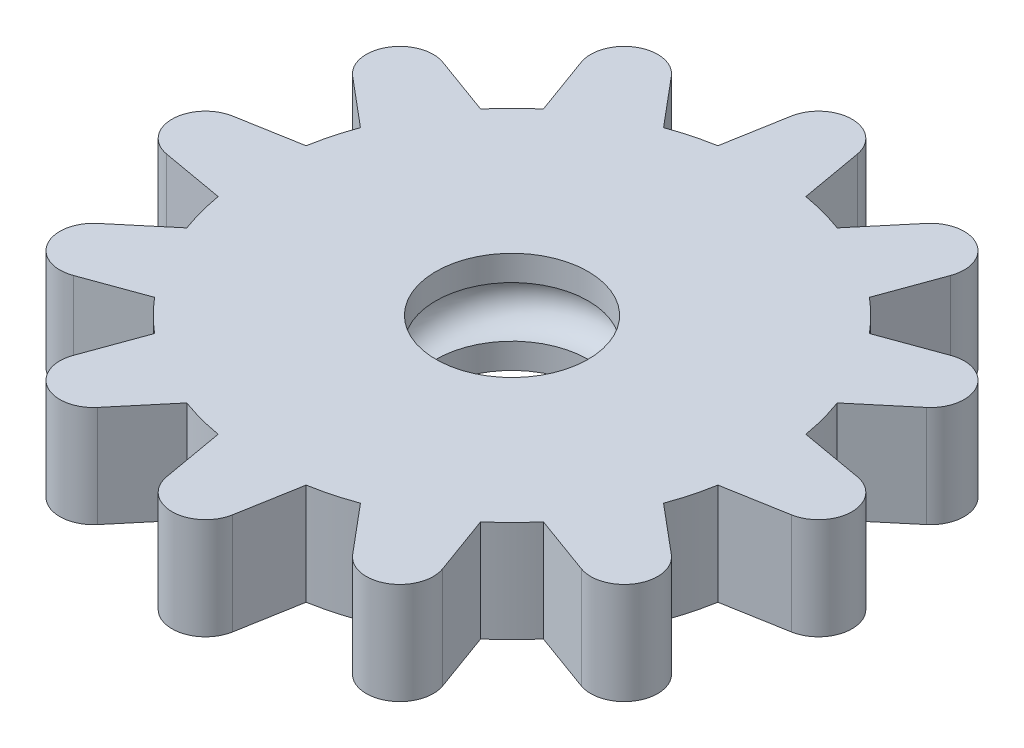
ISO-10303-21;
HEADER;
FILE_DESCRIPTION(('STEP AP214'),'2;1');
FILE_NAME('part.step','',(''),(''),'','','');
FILE_SCHEMA(('AUTOMOTIVE_DESIGN { 1 0 10303 214 1 1 1 1 }'));
ENDSEC;
DATA;
#1=APPLICATION_CONTEXT('core data for automotive mechanical design processes');
#2=APPLICATION_PROTOCOL_DEFINITION('international standard','automotive_design',2000,#1);
#3=PRODUCT_CONTEXT('',#1,'mechanical');
#4=PRODUCT('Part','Part','',(#3));
#5=PRODUCT_RELATED_PRODUCT_CATEGORY('part','',(#4));
#6=PRODUCT_DEFINITION_FORMATION('','',#4);
#7=PRODUCT_DEFINITION_CONTEXT('part definition',#1,'design');
#8=PRODUCT_DEFINITION('design','',#6,#7);
#9=PRODUCT_DEFINITION_SHAPE('','',#8);
#10=(LENGTH_UNIT() NAMED_UNIT(*) SI_UNIT(.MILLI.,.METRE.));
#11=(NAMED_UNIT(*) PLANE_ANGLE_UNIT() SI_UNIT($,.RADIAN.));
#12=(NAMED_UNIT(*) SI_UNIT($,.STERADIAN.) SOLID_ANGLE_UNIT());
#13=UNCERTAINTY_MEASURE_WITH_UNIT(LENGTH_MEASURE(1.E-05),#10,'distance_accuracy_value','');
#14=(GEOMETRIC_REPRESENTATION_CONTEXT(3) GLOBAL_UNCERTAINTY_ASSIGNED_CONTEXT((#13)) GLOBAL_UNIT_ASSIGNED_CONTEXT((#10,
#11,#12)) REPRESENTATION_CONTEXT('',''));
#15=CARTESIAN_POINT('',(0.,0.,0.));
#16=DIRECTION('',(0.,0.,1.));
#17=DIRECTION('',(1.,0.,0.));
#18=AXIS2_PLACEMENT_3D('',#15,#16,#17);
#19=CARTESIAN_POINT('',(0.,2.,0.));
#20=DIRECTION('',(0.,1.,0.));
#21=DIRECTION('',(0.,0.,1.));
#22=AXIS2_PLACEMENT_3D('',#19,#20,#21);
#23=PLANE('',#22);
#24=CARTESIAN_POINT('',(0.,2.,0.));
#25=DIRECTION('',(0.,1.,0.));
#26=DIRECTION('',(0.,0.,1.));
#27=AXIS2_PLACEMENT_3D('',#24,#25,#26);
#28=CIRCLE('',#27,5.);
#29=CARTESIAN_POINT('',(-0.866938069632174,2.,-4.92426830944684));
#30=VERTEX_POINT('',#29);
#31=CARTESIAN_POINT('',(-1.71134376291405,2.,-4.69801048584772));
#32=VERTEX_POINT('',#31);
#33=EDGE_CURVE('E59',#30,#32,#28,.T.);
#34=ORIENTED_EDGE('',*,*,#33,.T.);
#35=DIRECTION('',(-0.642787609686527,0.,-0.766044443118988));
#36=VECTOR('',#35,1.);
#37=CARTESIAN_POINT('',(-1.71134376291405,2.,-4.69801048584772));
#38=LINE('',#37,#36);
#39=CARTESIAN_POINT('',(-2.51437610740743,2.,-5.65502716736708));
#40=VERTEX_POINT('',#39);
#41=EDGE_CURVE('E707',#32,#40,#38,.T.);
#42=ORIENTED_EDGE('',*,*,#41,.T.);
#43=CARTESIAN_POINT('',(-3.01998635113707,2.,-5.2307697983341));
#44=DIRECTION('',(0.,1.,0.));
#45=DIRECTION('',(0.499999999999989,0.,0.866025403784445));
#46=AXIS2_PLACEMENT_3D('',#43,#44,#45);
#47=CIRCLE('',#46,0.660027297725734);
#48=CARTESIAN_POINT('',(-3.6402091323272,2.,-5.00502716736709));
#49=VERTEX_POINT('',#48);
#50=EDGE_CURVE('E688',#40,#49,#47,.T.);
#51=ORIENTED_EDGE('',*,*,#50,.T.);
#52=DIRECTION('',(0.342020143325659,0.,0.939692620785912));
#53=VECTOR('',#52,1.);
#54=CARTESIAN_POINT('',(-3.21292454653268,2.,-3.83107241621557));
#55=LINE('',#54,#53);
#56=CARTESIAN_POINT('',(-3.21292454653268,2.,-3.83107241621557));
#57=VERTEX_POINT('',#56);
#58=EDGE_CURVE('E698',#49,#57,#55,.T.);
#59=ORIENTED_EDGE('',*,*,#58,.T.);
#60=CARTESIAN_POINT('',(-3.83107241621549,2.,-3.21292454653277));
#61=VERTEX_POINT('',#60);
#62=EDGE_CURVE('E386',#57,#61,#28,.T.);
#63=ORIENTED_EDGE('',*,*,#62,.T.);
#64=DIRECTION('',(-0.939692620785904,0.,-0.342020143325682));
#65=VECTOR('',#64,1.);
#66=CARTESIAN_POINT('',(-3.83107241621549,2.,-3.21292454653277));
#67=LINE('',#66,#65);
#68=CARTESIAN_POINT('',(-5.005027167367,2.,-3.64020913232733));
#69=VERTEX_POINT('',#68);
#70=EDGE_CURVE('E679',#61,#69,#67,.T.);
#71=ORIENTED_EDGE('',*,*,#70,.T.);
#72=CARTESIAN_POINT('',(-5.23076979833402,2.,-3.01998635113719));
#73=DIRECTION('',(0.,1.,0.));
#74=DIRECTION('',(0.866025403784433,0.,0.50000000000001));
#75=AXIS2_PLACEMENT_3D('',#72,#73,#74);
#76=CIRCLE('',#75,0.660027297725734);
#77=CARTESIAN_POINT('',(-5.65502716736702,2.,-2.51437610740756));
#78=VERTEX_POINT('',#77);
#79=EDGE_CURVE('E659',#69,#78,#76,.T.);
#80=ORIENTED_EDGE('',*,*,#79,.T.);
#81=DIRECTION('',(0.766044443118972,0.,0.642787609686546));
#82=VECTOR('',#81,1.);
#83=CARTESIAN_POINT('',(-4.69801048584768,2.,-1.71134376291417));
#84=LINE('',#83,#82);
#85=CARTESIAN_POINT('',(-4.69801048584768,2.,-1.71134376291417));
#86=VERTEX_POINT('',#85);
#87=EDGE_CURVE('E670',#78,#86,#84,.T.);
#88=ORIENTED_EDGE('',*,*,#87,.T.);
#89=CARTESIAN_POINT('',(-4.92426830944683,2.,-0.866938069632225));
#90=VERTEX_POINT('',#89);
#91=EDGE_CURVE('E662',#86,#90,#28,.T.);
#92=ORIENTED_EDGE('',*,*,#91,.T.);
#93=DIRECTION('',(-0.98480775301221,0.,0.173648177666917));
#94=VECTOR('',#93,1.);
#95=CARTESIAN_POINT('',(-4.92426830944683,2.,-0.866938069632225));
#96=LINE('',#95,#94);
#97=CARTESIAN_POINT('',(-6.15458523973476,2.,-0.650000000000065));
#98=VERTEX_POINT('',#97);
#99=EDGE_CURVE('E649',#90,#98,#96,.T.);
#100=ORIENTED_EDGE('',*,*,#99,.T.);
#101=CARTESIAN_POINT('',(-6.03997270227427,2.,0.));
#102=DIRECTION('',(0.,1.,0.));
#103=DIRECTION('',(1.,0.,0.));
#104=AXIS2_PLACEMENT_3D('',#101,#102,#103);
#105=CIRCLE('',#104,0.660027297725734);
#106=CARTESIAN_POINT('',(-6.15458523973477,2.,0.649999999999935));
#107=VERTEX_POINT('',#106);
#108=EDGE_CURVE('E629',#98,#107,#105,.T.);
#109=ORIENTED_EDGE('',*,*,#108,.T.);
#110=DIRECTION('',(0.984807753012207,0.,0.173648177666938));
#111=VECTOR('',#110,1.);
#112=CARTESIAN_POINT('',(-4.92426830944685,2.,0.866938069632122));
#113=LINE('',#112,#111);
#114=CARTESIAN_POINT('',(-4.92426830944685,2.,0.866938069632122));
#115=VERTEX_POINT('',#114);
#116=EDGE_CURVE('E640',#107,#115,#113,.T.);
#117=ORIENTED_EDGE('',*,*,#116,.T.);
#118=CARTESIAN_POINT('',(-4.69801048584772,2.,1.71134376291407));
#119=VERTEX_POINT('',#118);
#120=EDGE_CURVE('E632',#115,#119,#28,.T.);
#121=ORIENTED_EDGE('',*,*,#120,.T.);
#122=DIRECTION('',(-0.766044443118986,0.,0.64278760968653));
#123=VECTOR('',#122,1.);
#124=CARTESIAN_POINT('',(-4.69801048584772,2.,1.71134376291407));
#125=LINE('',#124,#123);
#126=CARTESIAN_POINT('',(-5.65502716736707,2.,2.51437610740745));
#127=VERTEX_POINT('',#126);
#128=EDGE_CURVE('E619',#119,#127,#125,.T.);
#129=ORIENTED_EDGE('',*,*,#128,.T.);
#130=CARTESIAN_POINT('',(-5.23076979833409,2.,3.01998635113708));
#131=DIRECTION('',(0.,1.,0.));
#132=DIRECTION('',(0.866025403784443,0.,-0.499999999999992));
#133=AXIS2_PLACEMENT_3D('',#130,#131,#132);
#134=CIRCLE('',#133,0.660027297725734);
#135=CARTESIAN_POINT('',(-5.00502716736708,2.,3.64020913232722));
#136=VERTEX_POINT('',#135);
#137=EDGE_CURVE('E599',#127,#136,#134,.T.);
#138=ORIENTED_EDGE('',*,*,#137,.T.);
#139=DIRECTION('',(0.939692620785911,0.,-0.342020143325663));
#140=VECTOR('',#139,1.);
#141=CARTESIAN_POINT('',(-3.83107241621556,2.,3.21292454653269));
#142=LINE('',#141,#140);
#143=CARTESIAN_POINT('',(-3.83107241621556,2.,3.21292454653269));
#144=VERTEX_POINT('',#143);
#145=EDGE_CURVE('E610',#136,#144,#142,.T.);
#146=ORIENTED_EDGE('',*,*,#145,.T.);
#147=CARTESIAN_POINT('',(-3.21292454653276,2.,3.8310724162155));
#148=VERTEX_POINT('',#147);
#149=EDGE_CURVE('E602',#144,#148,#28,.T.);
#150=ORIENTED_EDGE('',*,*,#149,.T.);
#151=DIRECTION('',(-0.342020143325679,0.,0.939692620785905));
#152=VECTOR('',#151,1.);
#153=CARTESIAN_POINT('',(-3.21292454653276,2.,3.8310724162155));
#154=LINE('',#153,#152);
#155=CARTESIAN_POINT('',(-3.64020913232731,2.,5.00502716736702));
#156=VERTEX_POINT('',#155);
#157=EDGE_CURVE('E589',#148,#156,#154,.T.);
#158=ORIENTED_EDGE('',*,*,#157,.T.);
#159=CARTESIAN_POINT('',(-3.01998635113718,2.,5.23076979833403));
#160=DIRECTION('',(0.,1.,0.));
#161=DIRECTION('',(0.500000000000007,0.,-0.866025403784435));
#162=AXIS2_PLACEMENT_3D('',#159,#160,#161);
#163=CIRCLE('',#162,0.660027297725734);
#164=CARTESIAN_POINT('',(-2.51437610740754,2.,5.65502716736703));
#165=VERTEX_POINT('',#164);
#166=EDGE_CURVE('E569',#156,#165,#163,.T.);
#167=ORIENTED_EDGE('',*,*,#166,.T.);
#168=DIRECTION('',(0.642787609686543,0.,-0.766044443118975));
#169=VECTOR('',#168,1.);
#170=CARTESIAN_POINT('',(-1.71134376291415,2.,4.69801048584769));
#171=LINE('',#170,#169);
#172=CARTESIAN_POINT('',(-1.71134376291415,2.,4.69801048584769));
#173=VERTEX_POINT('',#172);
#174=EDGE_CURVE('E580',#165,#173,#171,.T.);
#175=ORIENTED_EDGE('',*,*,#174,.T.);
#176=CARTESIAN_POINT('',(-0.866938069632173,2.,4.92426830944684));
#177=VERTEX_POINT('',#176);
#178=EDGE_CURVE('E572',#173,#177,#28,.T.);
#179=ORIENTED_EDGE('',*,*,#178,.T.);
#180=DIRECTION('',(0.173648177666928,0.,0.984807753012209));
#181=VECTOR('',#180,1.);
#182=CARTESIAN_POINT('',(-0.866938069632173,2.,4.92426830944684));
#183=LINE('',#182,#181);
#184=CARTESIAN_POINT('',(-0.65,2.,6.15458523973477));
#185=VERTEX_POINT('',#184);
#186=EDGE_CURVE('E559',#177,#185,#183,.T.);
#187=ORIENTED_EDGE('',*,*,#186,.T.);
#188=CARTESIAN_POINT('',(0.,2.,6.03997270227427));
#189=DIRECTION('',(0.,1.,0.));
#190=DIRECTION('',(0.,0.,-1.));
#191=AXIS2_PLACEMENT_3D('',#188,#189,#190);
#192=CIRCLE('',#191,0.660027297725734);
#193=CARTESIAN_POINT('',(0.65,2.,6.15458523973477));
#194=VERTEX_POINT('',#193);
#195=EDGE_CURVE('E539',#185,#194,#192,.T.);
#196=ORIENTED_EDGE('',*,*,#195,.T.);
#197=DIRECTION('',(0.173648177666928,0.,-0.984807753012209));
#198=VECTOR('',#197,1.);
#199=CARTESIAN_POINT('',(0.866938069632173,2.,4.92426830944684));
#200=LINE('',#199,#198);
#201=CARTESIAN_POINT('',(0.866938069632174,2.,4.92426830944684));
#202=VERTEX_POINT('',#201);
#203=EDGE_CURVE('E550',#194,#202,#200,.T.);
#204=ORIENTED_EDGE('',*,*,#203,.T.);
#205=CARTESIAN_POINT('',(1.71134376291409,2.,4.69801048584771));
#206=VERTEX_POINT('',#205);
#207=EDGE_CURVE('E542',#202,#206,#28,.T.);
#208=ORIENTED_EDGE('',*,*,#207,.T.);
#209=DIRECTION('',(0.642787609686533,0.,0.766044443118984));
#210=VECTOR('',#209,1.);
#211=CARTESIAN_POINT('',(1.71134376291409,2.,4.69801048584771));
#212=LINE('',#211,#210);
#213=CARTESIAN_POINT('',(2.51437610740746,2.,5.65502716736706));
#214=VERTEX_POINT('',#213);
#215=EDGE_CURVE('E529',#206,#214,#212,.T.);
#216=ORIENTED_EDGE('',*,*,#215,.T.);
#217=CARTESIAN_POINT('',(3.0199863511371,2.,5.23076979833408));
#218=DIRECTION('',(0.,1.,0.));
#219=DIRECTION('',(-0.499999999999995,0.,-0.866025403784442));
#220=AXIS2_PLACEMENT_3D('',#217,#218,#219);
#221=CIRCLE('',#220,0.660027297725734);
#222=CARTESIAN_POINT('',(3.64020913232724,2.,5.00502716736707));
#223=VERTEX_POINT('',#222);
#224=EDGE_CURVE('E509',#214,#223,#221,.T.);
#225=ORIENTED_EDGE('',*,*,#224,.T.);
#226=DIRECTION('',(-0.342020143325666,0.,-0.93969262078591));
#227=VECTOR('',#226,1.);
#228=CARTESIAN_POINT('',(3.2129245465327,2.,3.83107241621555));
#229=LINE('',#228,#227);
#230=CARTESIAN_POINT('',(3.2129245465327,2.,3.83107241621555));
#231=VERTEX_POINT('',#230);
#232=EDGE_CURVE('E520',#223,#231,#229,.T.);
#233=ORIENTED_EDGE('',*,*,#232,.T.);
#234=CARTESIAN_POINT('',(3.83107241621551,2.,3.21292454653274));
#235=VERTEX_POINT('',#234);
#236=EDGE_CURVE('E512',#231,#235,#28,.T.);
#237=ORIENTED_EDGE('',*,*,#236,.T.);
#238=DIRECTION('',(0.939692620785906,0.,0.342020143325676));
#239=VECTOR('',#238,1.);
#240=CARTESIAN_POINT('',(3.83107241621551,2.,3.21292454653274));
#241=LINE('',#240,#239);
#242=CARTESIAN_POINT('',(5.00502716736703,2.,3.64020913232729));
#243=VERTEX_POINT('',#242);
#244=EDGE_CURVE('E499',#235,#243,#241,.T.);
#245=ORIENTED_EDGE('',*,*,#244,.T.);
#246=CARTESIAN_POINT('',(5.23076979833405,2.,3.01998635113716));
#247=DIRECTION('',(0.,1.,0.));
#248=DIRECTION('',(-0.866025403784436,0.,-0.500000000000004));
#249=AXIS2_PLACEMENT_3D('',#246,#247,#248);
#250=CIRCLE('',#249,0.660027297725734);
#251=CARTESIAN_POINT('',(5.65502716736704,2.,2.51437610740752));
#252=VERTEX_POINT('',#251);
#253=EDGE_CURVE('E479',#243,#252,#250,.T.);
#254=ORIENTED_EDGE('',*,*,#253,.T.);
#255=DIRECTION('',(-0.766044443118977,0.,-0.642787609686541));
#256=VECTOR('',#255,1.);
#257=CARTESIAN_POINT('',(4.69801048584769,2.,1.71134376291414));
#258=LINE('',#257,#256);
#259=CARTESIAN_POINT('',(4.6980104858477,2.,1.71134376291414));
#260=VERTEX_POINT('',#259);
#261=EDGE_CURVE('E490',#252,#260,#258,.T.);
#262=ORIENTED_EDGE('',*,*,#261,.T.);
#263=CARTESIAN_POINT('',(4.92426830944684,2.,0.866938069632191));
#264=VERTEX_POINT('',#263);
#265=EDGE_CURVE('E482',#260,#264,#28,.T.);
#266=ORIENTED_EDGE('',*,*,#265,.T.);
#267=DIRECTION('',(0.984807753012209,0.,-0.173648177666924));
#268=VECTOR('',#267,1.);
#269=CARTESIAN_POINT('',(4.92426830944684,2.,0.866938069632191));
#270=LINE('',#269,#268);
#271=CARTESIAN_POINT('',(6.15458523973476,2.,0.650000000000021));
#272=VERTEX_POINT('',#271);
#273=EDGE_CURVE('E469',#264,#272,#270,.T.);
#274=ORIENTED_EDGE('',*,*,#273,.T.);
#275=CARTESIAN_POINT('',(6.03997270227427,2.,0.));
#276=DIRECTION('',(0.,1.,0.));
#277=DIRECTION('',(-1.,0.,0.));
#278=AXIS2_PLACEMENT_3D('',#275,#276,#277);
#279=CIRCLE('',#278,0.660027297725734);
#280=CARTESIAN_POINT('',(6.15458523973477,2.,-0.649999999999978));
#281=VERTEX_POINT('',#280);
#282=EDGE_CURVE('E449',#272,#281,#279,.T.);
#283=ORIENTED_EDGE('',*,*,#282,.T.);
#284=DIRECTION('',(-0.984807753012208,0.,-0.173648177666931));
#285=VECTOR('',#284,1.);
#286=CARTESIAN_POINT('',(4.92426830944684,2.,-0.866938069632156));
#287=LINE('',#286,#285);
#288=CARTESIAN_POINT('',(4.92426830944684,2.,-0.866938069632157));
#289=VERTEX_POINT('',#288);
#290=EDGE_CURVE('E460',#281,#289,#287,.T.);
#291=ORIENTED_EDGE('',*,*,#290,.T.);
#292=CARTESIAN_POINT('',(4.69801048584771,2.,-1.7113437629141));
#293=VERTEX_POINT('',#292);
#294=EDGE_CURVE('E452',#289,#293,#28,.T.);
#295=ORIENTED_EDGE('',*,*,#294,.T.);
#296=DIRECTION('',(0.766044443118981,0.,-0.642787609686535));
#297=VECTOR('',#296,1.);
#298=CARTESIAN_POINT('',(4.69801048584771,2.,-1.7113437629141));
#299=LINE('',#298,#297);
#300=CARTESIAN_POINT('',(5.65502716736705,2.,-2.51437610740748));
#301=VERTEX_POINT('',#300);
#302=EDGE_CURVE('E439',#293,#301,#299,.T.);
#303=ORIENTED_EDGE('',*,*,#302,.T.);
#304=CARTESIAN_POINT('',(5.23076979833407,2.,-3.01998635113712));
#305=DIRECTION('',(0.,1.,0.));
#306=DIRECTION('',(-0.86602540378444,0.,0.499999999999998));
#307=AXIS2_PLACEMENT_3D('',#304,#305,#306);
#308=CIRCLE('',#307,0.660027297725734);
#309=CARTESIAN_POINT('',(5.00502716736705,2.,-3.64020913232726));
#310=VERTEX_POINT('',#309);
#311=EDGE_CURVE('E419',#301,#310,#308,.T.);
#312=ORIENTED_EDGE('',*,*,#311,.T.);
#313=DIRECTION('',(-0.939692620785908,0.,0.342020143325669));
#314=VECTOR('',#313,1.);
#315=CARTESIAN_POINT('',(3.83107241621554,2.,-3.21292454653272));
#316=LINE('',#315,#314);
#317=CARTESIAN_POINT('',(3.83107241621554,2.,-3.21292454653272));
#318=VERTEX_POINT('',#317);
#319=EDGE_CURVE('E430',#310,#318,#316,.T.);
#320=ORIENTED_EDGE('',*,*,#319,.T.);
#321=CARTESIAN_POINT('',(3.21292454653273,2.,-3.83107241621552));
#322=VERTEX_POINT('',#321);
#323=EDGE_CURVE('E422',#318,#322,#28,.T.);
#324=ORIENTED_EDGE('',*,*,#323,.T.);
#325=DIRECTION('',(0.342020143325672,0.,-0.939692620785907));
#326=VECTOR('',#325,1.);
#327=CARTESIAN_POINT('',(3.21292454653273,2.,-3.83107241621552));
#328=LINE('',#327,#326);
#329=CARTESIAN_POINT('',(3.64020913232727,2.,-5.00502716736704));
#330=VERTEX_POINT('',#329);
#331=EDGE_CURVE('E409',#322,#330,#328,.T.);
#332=ORIENTED_EDGE('',*,*,#331,.T.);
#333=CARTESIAN_POINT('',(3.01998635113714,2.,-5.23076979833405));
#334=DIRECTION('',(0.,1.,0.));
#335=DIRECTION('',(-0.500000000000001,0.,0.866025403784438));
#336=AXIS2_PLACEMENT_3D('',#333,#334,#335);
#337=CIRCLE('',#336,0.660027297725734);
#338=CARTESIAN_POINT('',(2.5143761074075,2.,-5.65502716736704));
#339=VERTEX_POINT('',#338);
#340=EDGE_CURVE('E390',#330,#339,#337,.T.);
#341=ORIENTED_EDGE('',*,*,#340,.T.);
#342=DIRECTION('',(-0.642787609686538,0.,0.766044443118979));
#343=VECTOR('',#342,1.);
#344=CARTESIAN_POINT('',(1.71134376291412,2.,-4.6980104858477));
#345=LINE('',#344,#343);
#346=CARTESIAN_POINT('',(1.71134376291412,2.,-4.6980104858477));
#347=VERTEX_POINT('',#346);
#348=EDGE_CURVE('E400',#339,#347,#345,.T.);
#349=ORIENTED_EDGE('',*,*,#348,.T.);
#350=CARTESIAN_POINT('',(0.866938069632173,2.,-4.92426830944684));
#351=VERTEX_POINT('',#350);
#352=EDGE_CURVE('E387',#347,#351,#28,.T.);
#353=ORIENTED_EDGE('',*,*,#352,.T.);
#354=DIRECTION('',(-0.173648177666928,0.,-0.984807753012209));
#355=VECTOR('',#354,1.);
#356=CARTESIAN_POINT('',(0.866938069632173,2.,-4.92426830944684));
#357=LINE('',#356,#355);
#358=CARTESIAN_POINT('',(0.65,2.,-6.15458523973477));
#359=VERTEX_POINT('',#358);
#360=EDGE_CURVE('E376',#351,#359,#357,.T.);
#361=ORIENTED_EDGE('',*,*,#360,.T.);
#362=CARTESIAN_POINT('',(0.,2.,-6.03997270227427));
#363=DIRECTION('',(0.,1.,0.));
#364=DIRECTION('',(0.,0.,1.));
#365=AXIS2_PLACEMENT_3D('',#362,#363,#364);
#366=CIRCLE('',#365,0.660027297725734);
#367=CARTESIAN_POINT('',(-0.65,2.,-6.15458523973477));
#368=VERTEX_POINT('',#367);
#369=EDGE_CURVE('E349',#359,#368,#366,.T.);
#370=ORIENTED_EDGE('',*,*,#369,.T.);
#371=DIRECTION('',(-0.173648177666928,0.,0.984807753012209));
#372=VECTOR('',#371,1.);
#373=CARTESIAN_POINT('',(-0.866938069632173,2.,-4.92426830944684));
#374=LINE('',#373,#372);
#375=EDGE_CURVE('E368',#368,#30,#374,.T.);
#376=ORIENTED_EDGE('',*,*,#375,.T.);
#377=EDGE_LOOP('',(#34,#42,#51,#59,#63,#71,#80,#88,#92,#100,#109,#117,#121,#129,#138,#146,#150,
#158,#167,#175,#179,#187,#196,#204,#208,#216,#225,#233,#237,#245,#254,#262,#266,#274,#283,#291,
#295,#303,#312,#320,#324,#332,#341,#349,#353,#361,#370,#376));
#378=FACE_BOUND('',#377,.T.);
#379=CARTESIAN_POINT('',(0.,2.,0.));
#380=DIRECTION('',(0.,-1.,0.));
#381=DIRECTION('',(0.,0.,-1.));
#382=AXIS2_PLACEMENT_3D('',#379,#380,#381);
#383=CIRCLE('',#382,1.5);
#384=CARTESIAN_POINT('',(0.,2.,-1.5));
#385=VERTEX_POINT('',#384);
#386=EDGE_CURVE('E815',#385,#385,#383,.T.);
#387=ORIENTED_EDGE('',*,*,#386,.T.);
#388=EDGE_LOOP('',(#387));
#389=FACE_BOUND('',#388,.T.);
#390=ADVANCED_FACE('F36',(#378,#389),#23,.T.);
#391=CARTESIAN_POINT('',(0.,0.,0.));
#392=DIRECTION('',(0.,1.,0.));
#393=DIRECTION('',(0.,0.,1.));
#394=AXIS2_PLACEMENT_3D('',#391,#392,#393);
#395=PLANE('',#394);
#396=CARTESIAN_POINT('',(0.,0.,0.));
#397=DIRECTION('',(0.,1.,0.));
#398=DIRECTION('',(0.,0.,1.));
#399=AXIS2_PLACEMENT_3D('',#396,#397,#398);
#400=CIRCLE('',#399,5.);
#401=CARTESIAN_POINT('',(-0.866938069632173,0.,-4.92426830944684));
#402=VERTEX_POINT('',#401);
#403=CARTESIAN_POINT('',(-1.71134376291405,0.,-4.69801048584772));
#404=VERTEX_POINT('',#403);
#405=EDGE_CURVE('E51',#402,#404,#400,.T.);
#406=ORIENTED_EDGE('',*,*,#405,.F.);
#407=DIRECTION('',(-0.173648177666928,0.,0.984807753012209));
#408=VECTOR('',#407,1.);
#409=CARTESIAN_POINT('',(-0.866938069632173,0.,-4.92426830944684));
#410=LINE('',#409,#408);
#411=CARTESIAN_POINT('',(-0.65,0.,-6.15458523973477));
#412=VERTEX_POINT('',#411);
#413=EDGE_CURVE('E355',#412,#402,#410,.T.);
#414=ORIENTED_EDGE('',*,*,#413,.F.);
#415=CARTESIAN_POINT('',(0.,0.,-6.03997270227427));
#416=DIRECTION('',(0.,1.,0.));
#417=DIRECTION('',(0.,0.,1.));
#418=AXIS2_PLACEMENT_3D('',#415,#416,#417);
#419=CIRCLE('',#418,0.660027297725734);
#420=CARTESIAN_POINT('',(0.65,0.,-6.15458523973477));
#421=VERTEX_POINT('',#420);
#422=EDGE_CURVE('E347',#421,#412,#419,.T.);
#423=ORIENTED_EDGE('',*,*,#422,.F.);
#424=DIRECTION('',(-0.173648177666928,0.,-0.984807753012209));
#425=VECTOR('',#424,1.);
#426=CARTESIAN_POINT('',(0.866938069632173,0.,-4.92426830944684));
#427=LINE('',#426,#425);
#428=CARTESIAN_POINT('',(0.866938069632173,0.,-4.92426830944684));
#429=VERTEX_POINT('',#428);
#430=EDGE_CURVE('E362',#429,#421,#427,.T.);
#431=ORIENTED_EDGE('',*,*,#430,.F.);
#432=CARTESIAN_POINT('',(1.71134376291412,0.,-4.6980104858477));
#433=VERTEX_POINT('',#432);
#434=EDGE_CURVE('E385',#433,#429,#400,.T.);
#435=ORIENTED_EDGE('',*,*,#434,.F.);
#436=DIRECTION('',(-0.642787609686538,0.,0.766044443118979));
#437=VECTOR('',#436,1.);
#438=CARTESIAN_POINT('',(1.71134376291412,0.,-4.6980104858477));
#439=LINE('',#438,#437);
#440=CARTESIAN_POINT('',(2.5143761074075,0.,-5.65502716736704));
#441=VERTEX_POINT('',#440);
#442=EDGE_CURVE('E403',#441,#433,#439,.T.);
#443=ORIENTED_EDGE('',*,*,#442,.F.);
#444=CARTESIAN_POINT('',(3.01998635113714,0.,-5.23076979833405));
#445=DIRECTION('',(0.,1.,0.));
#446=DIRECTION('',(-0.500000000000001,0.,0.866025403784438));
#447=AXIS2_PLACEMENT_3D('',#444,#445,#446);
#448=CIRCLE('',#447,0.660027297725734);
#449=CARTESIAN_POINT('',(3.64020913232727,0.,-5.00502716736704));
#450=VERTEX_POINT('',#449);
#451=EDGE_CURVE('E395',#450,#441,#448,.T.);
#452=ORIENTED_EDGE('',*,*,#451,.F.);
#453=DIRECTION('',(0.342020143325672,0.,-0.939692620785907));
#454=VECTOR('',#453,1.);
#455=CARTESIAN_POINT('',(3.21292454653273,0.,-3.83107241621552));
#456=LINE('',#455,#454);
#457=CARTESIAN_POINT('',(3.21292454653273,0.,-3.83107241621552));
#458=VERTEX_POINT('',#457);
#459=EDGE_CURVE('E415',#458,#450,#456,.T.);
#460=ORIENTED_EDGE('',*,*,#459,.F.);
#461=CARTESIAN_POINT('',(3.83107241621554,0.,-3.21292454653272));
#462=VERTEX_POINT('',#461);
#463=EDGE_CURVE('E418',#462,#458,#400,.T.);
#464=ORIENTED_EDGE('',*,*,#463,.F.);
#465=DIRECTION('',(-0.939692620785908,0.,0.342020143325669));
#466=VECTOR('',#465,1.);
#467=CARTESIAN_POINT('',(3.83107241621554,0.,-3.21292454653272));
#468=LINE('',#467,#466);
#469=CARTESIAN_POINT('',(5.00502716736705,0.,-3.64020913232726));
#470=VERTEX_POINT('',#469);
#471=EDGE_CURVE('E433',#470,#462,#468,.T.);
#472=ORIENTED_EDGE('',*,*,#471,.F.);
#473=CARTESIAN_POINT('',(5.23076979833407,0.,-3.01998635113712));
#474=DIRECTION('',(0.,1.,0.));
#475=DIRECTION('',(-0.86602540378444,0.,0.499999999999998));
#476=AXIS2_PLACEMENT_3D('',#473,#474,#475);
#477=CIRCLE('',#476,0.660027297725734);
#478=CARTESIAN_POINT('',(5.65502716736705,0.,-2.51437610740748));
#479=VERTEX_POINT('',#478);
#480=EDGE_CURVE('E425',#479,#470,#477,.T.);
#481=ORIENTED_EDGE('',*,*,#480,.F.);
#482=DIRECTION('',(0.766044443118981,0.,-0.642787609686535));
#483=VECTOR('',#482,1.);
#484=CARTESIAN_POINT('',(4.69801048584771,0.,-1.7113437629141));
#485=LINE('',#484,#483);
#486=CARTESIAN_POINT('',(4.69801048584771,0.,-1.7113437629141));
#487=VERTEX_POINT('',#486);
#488=EDGE_CURVE('E445',#487,#479,#485,.T.);
#489=ORIENTED_EDGE('',*,*,#488,.F.);
#490=CARTESIAN_POINT('',(4.92426830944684,0.,-0.866938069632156));
#491=VERTEX_POINT('',#490);
#492=EDGE_CURVE('E448',#491,#487,#400,.T.);
#493=ORIENTED_EDGE('',*,*,#492,.F.);
#494=DIRECTION('',(-0.984807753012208,0.,-0.173648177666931));
#495=VECTOR('',#494,1.);
#496=CARTESIAN_POINT('',(4.92426830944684,0.,-0.866938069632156));
#497=LINE('',#496,#495);
#498=CARTESIAN_POINT('',(6.15458523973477,0.,-0.649999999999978));
#499=VERTEX_POINT('',#498);
#500=EDGE_CURVE('E463',#499,#491,#497,.T.);
#501=ORIENTED_EDGE('',*,*,#500,.F.);
#502=CARTESIAN_POINT('',(6.03997270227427,0.,0.));
#503=DIRECTION('',(0.,1.,0.));
#504=DIRECTION('',(-1.,0.,0.));
#505=AXIS2_PLACEMENT_3D('',#502,#503,#504);
#506=CIRCLE('',#505,0.660027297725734);
#507=CARTESIAN_POINT('',(6.15458523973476,0.,0.650000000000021));
#508=VERTEX_POINT('',#507);
#509=EDGE_CURVE('E455',#508,#499,#506,.T.);
#510=ORIENTED_EDGE('',*,*,#509,.F.);
#511=DIRECTION('',(0.984807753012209,0.,-0.173648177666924));
#512=VECTOR('',#511,1.);
#513=CARTESIAN_POINT('',(4.92426830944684,0.,0.866938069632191));
#514=LINE('',#513,#512);
#515=CARTESIAN_POINT('',(4.92426830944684,0.,0.866938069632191));
#516=VERTEX_POINT('',#515);
#517=EDGE_CURVE('E475',#516,#508,#514,.T.);
#518=ORIENTED_EDGE('',*,*,#517,.F.);
#519=CARTESIAN_POINT('',(4.69801048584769,0.,1.71134376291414));
#520=VERTEX_POINT('',#519);
#521=EDGE_CURVE('E478',#520,#516,#400,.T.);
#522=ORIENTED_EDGE('',*,*,#521,.F.);
#523=DIRECTION('',(-0.766044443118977,0.,-0.642787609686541));
#524=VECTOR('',#523,1.);
#525=CARTESIAN_POINT('',(4.69801048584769,0.,1.71134376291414));
#526=LINE('',#525,#524);
#527=CARTESIAN_POINT('',(5.65502716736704,0.,2.51437610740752));
#528=VERTEX_POINT('',#527);
#529=EDGE_CURVE('E493',#528,#520,#526,.T.);
#530=ORIENTED_EDGE('',*,*,#529,.F.);
#531=CARTESIAN_POINT('',(5.23076979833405,0.,3.01998635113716));
#532=DIRECTION('',(0.,1.,0.));
#533=DIRECTION('',(-0.866025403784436,0.,-0.500000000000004));
#534=AXIS2_PLACEMENT_3D('',#531,#532,#533);
#535=CIRCLE('',#534,0.660027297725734);
#536=CARTESIAN_POINT('',(5.00502716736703,0.,3.64020913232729));
#537=VERTEX_POINT('',#536);
#538=EDGE_CURVE('E485',#537,#528,#535,.T.);
#539=ORIENTED_EDGE('',*,*,#538,.F.);
#540=DIRECTION('',(0.939692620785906,0.,0.342020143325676));
#541=VECTOR('',#540,1.);
#542=CARTESIAN_POINT('',(3.83107241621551,0.,3.21292454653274));
#543=LINE('',#542,#541);
#544=CARTESIAN_POINT('',(3.83107241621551,0.,3.21292454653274));
#545=VERTEX_POINT('',#544);
#546=EDGE_CURVE('E505',#545,#537,#543,.T.);
#547=ORIENTED_EDGE('',*,*,#546,.F.);
#548=CARTESIAN_POINT('',(3.2129245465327,0.,3.83107241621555));
#549=VERTEX_POINT('',#548);
#550=EDGE_CURVE('E508',#549,#545,#400,.T.);
#551=ORIENTED_EDGE('',*,*,#550,.F.);
#552=DIRECTION('',(-0.342020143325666,0.,-0.93969262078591));
#553=VECTOR('',#552,1.);
#554=CARTESIAN_POINT('',(3.2129245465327,0.,3.83107241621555));
#555=LINE('',#554,#553);
#556=CARTESIAN_POINT('',(3.64020913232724,0.,5.00502716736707));
#557=VERTEX_POINT('',#556);
#558=EDGE_CURVE('E523',#557,#549,#555,.T.);
#559=ORIENTED_EDGE('',*,*,#558,.F.);
#560=CARTESIAN_POINT('',(3.0199863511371,0.,5.23076979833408));
#561=DIRECTION('',(0.,1.,0.));
#562=DIRECTION('',(-0.499999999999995,0.,-0.866025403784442));
#563=AXIS2_PLACEMENT_3D('',#560,#561,#562);
#564=CIRCLE('',#563,0.660027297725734);
#565=CARTESIAN_POINT('',(2.51437610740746,0.,5.65502716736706));
#566=VERTEX_POINT('',#565);
#567=EDGE_CURVE('E515',#566,#557,#564,.T.);
#568=ORIENTED_EDGE('',*,*,#567,.F.);
#569=DIRECTION('',(0.642787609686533,0.,0.766044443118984));
#570=VECTOR('',#569,1.);
#571=CARTESIAN_POINT('',(1.71134376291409,0.,4.69801048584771));
#572=LINE('',#571,#570);
#573=CARTESIAN_POINT('',(1.71134376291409,0.,4.69801048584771));
#574=VERTEX_POINT('',#573);
#575=EDGE_CURVE('E535',#574,#566,#572,.T.);
#576=ORIENTED_EDGE('',*,*,#575,.F.);
#577=CARTESIAN_POINT('',(0.866938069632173,0.,4.92426830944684));
#578=VERTEX_POINT('',#577);
#579=EDGE_CURVE('E538',#578,#574,#400,.T.);
#580=ORIENTED_EDGE('',*,*,#579,.F.);
#581=DIRECTION('',(0.173648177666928,0.,-0.984807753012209));
#582=VECTOR('',#581,1.);
#583=CARTESIAN_POINT('',(0.866938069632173,0.,4.92426830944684));
#584=LINE('',#583,#582);
#585=CARTESIAN_POINT('',(0.65,0.,6.15458523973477));
#586=VERTEX_POINT('',#585);
#587=EDGE_CURVE('E553',#586,#578,#584,.T.);
#588=ORIENTED_EDGE('',*,*,#587,.F.);
#589=CARTESIAN_POINT('',(0.,0.,6.03997270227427));
#590=DIRECTION('',(0.,1.,0.));
#591=DIRECTION('',(0.,0.,-1.));
#592=AXIS2_PLACEMENT_3D('',#589,#590,#591);
#593=CIRCLE('',#592,0.660027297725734);
#594=CARTESIAN_POINT('',(-0.65,0.,6.15458523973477));
#595=VERTEX_POINT('',#594);
#596=EDGE_CURVE('E545',#595,#586,#593,.T.);
#597=ORIENTED_EDGE('',*,*,#596,.F.);
#598=DIRECTION('',(0.173648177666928,0.,0.984807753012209));
#599=VECTOR('',#598,1.);
#600=CARTESIAN_POINT('',(-0.866938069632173,0.,4.92426830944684));
#601=LINE('',#600,#599);
#602=CARTESIAN_POINT('',(-0.866938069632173,0.,4.92426830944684));
#603=VERTEX_POINT('',#602);
#604=EDGE_CURVE('E565',#603,#595,#601,.T.);
#605=ORIENTED_EDGE('',*,*,#604,.F.);
#606=CARTESIAN_POINT('',(-1.71134376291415,0.,4.69801048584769));
#607=VERTEX_POINT('',#606);
#608=EDGE_CURVE('E568',#607,#603,#400,.T.);
#609=ORIENTED_EDGE('',*,*,#608,.F.);
#610=DIRECTION('',(0.642787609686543,0.,-0.766044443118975));
#611=VECTOR('',#610,1.);
#612=CARTESIAN_POINT('',(-1.71134376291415,0.,4.69801048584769));
#613=LINE('',#612,#611);
#614=CARTESIAN_POINT('',(-2.51437610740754,0.,5.65502716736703));
#615=VERTEX_POINT('',#614);
#616=EDGE_CURVE('E583',#615,#607,#613,.T.);
#617=ORIENTED_EDGE('',*,*,#616,.F.);
#618=CARTESIAN_POINT('',(-3.01998635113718,0.,5.23076979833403));
#619=DIRECTION('',(0.,1.,0.));
#620=DIRECTION('',(0.500000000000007,0.,-0.866025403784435));
#621=AXIS2_PLACEMENT_3D('',#618,#619,#620);
#622=CIRCLE('',#621,0.660027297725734);
#623=CARTESIAN_POINT('',(-3.64020913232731,0.,5.00502716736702));
#624=VERTEX_POINT('',#623);
#625=EDGE_CURVE('E575',#624,#615,#622,.T.);
#626=ORIENTED_EDGE('',*,*,#625,.F.);
#627=DIRECTION('',(-0.342020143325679,0.,0.939692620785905));
#628=VECTOR('',#627,1.);
#629=CARTESIAN_POINT('',(-3.21292454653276,0.,3.8310724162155));
#630=LINE('',#629,#628);
#631=CARTESIAN_POINT('',(-3.21292454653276,0.,3.8310724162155));
#632=VERTEX_POINT('',#631);
#633=EDGE_CURVE('E595',#632,#624,#630,.T.);
#634=ORIENTED_EDGE('',*,*,#633,.F.);
#635=CARTESIAN_POINT('',(-3.83107241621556,0.,3.21292454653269));
#636=VERTEX_POINT('',#635);
#637=EDGE_CURVE('E598',#636,#632,#400,.T.);
#638=ORIENTED_EDGE('',*,*,#637,.F.);
#639=DIRECTION('',(0.939692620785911,0.,-0.342020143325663));
#640=VECTOR('',#639,1.);
#641=CARTESIAN_POINT('',(-3.83107241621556,0.,3.21292454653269));
#642=LINE('',#641,#640);
#643=CARTESIAN_POINT('',(-5.00502716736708,0.,3.64020913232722));
#644=VERTEX_POINT('',#643);
#645=EDGE_CURVE('E613',#644,#636,#642,.T.);
#646=ORIENTED_EDGE('',*,*,#645,.F.);
#647=CARTESIAN_POINT('',(-5.23076979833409,0.,3.01998635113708));
#648=DIRECTION('',(0.,1.,0.));
#649=DIRECTION('',(0.866025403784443,0.,-0.499999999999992));
#650=AXIS2_PLACEMENT_3D('',#647,#648,#649);
#651=CIRCLE('',#650,0.660027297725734);
#652=CARTESIAN_POINT('',(-5.65502716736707,0.,2.51437610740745));
#653=VERTEX_POINT('',#652);
#654=EDGE_CURVE('E605',#653,#644,#651,.T.);
#655=ORIENTED_EDGE('',*,*,#654,.F.);
#656=DIRECTION('',(-0.766044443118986,0.,0.64278760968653));
#657=VECTOR('',#656,1.);
#658=CARTESIAN_POINT('',(-4.69801048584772,0.,1.71134376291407));
#659=LINE('',#658,#657);
#660=CARTESIAN_POINT('',(-4.69801048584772,0.,1.71134376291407));
#661=VERTEX_POINT('',#660);
#662=EDGE_CURVE('E625',#661,#653,#659,.T.);
#663=ORIENTED_EDGE('',*,*,#662,.F.);
#664=CARTESIAN_POINT('',(-4.92426830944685,0.,0.866938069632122));
#665=VERTEX_POINT('',#664);
#666=EDGE_CURVE('E628',#665,#661,#400,.T.);
#667=ORIENTED_EDGE('',*,*,#666,.F.);
#668=DIRECTION('',(0.984807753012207,0.,0.173648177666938));
#669=VECTOR('',#668,1.);
#670=CARTESIAN_POINT('',(-4.92426830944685,0.,0.866938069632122));
#671=LINE('',#670,#669);
#672=CARTESIAN_POINT('',(-6.15458523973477,0.,0.649999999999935));
#673=VERTEX_POINT('',#672);
#674=EDGE_CURVE('E643',#673,#665,#671,.T.);
#675=ORIENTED_EDGE('',*,*,#674,.F.);
#676=CARTESIAN_POINT('',(-6.03997270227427,0.,0.));
#677=DIRECTION('',(0.,1.,0.));
#678=DIRECTION('',(1.,0.,0.));
#679=AXIS2_PLACEMENT_3D('',#676,#677,#678);
#680=CIRCLE('',#679,0.660027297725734);
#681=CARTESIAN_POINT('',(-6.15458523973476,0.,-0.650000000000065));
#682=VERTEX_POINT('',#681);
#683=EDGE_CURVE('E635',#682,#673,#680,.T.);
#684=ORIENTED_EDGE('',*,*,#683,.F.);
#685=DIRECTION('',(-0.98480775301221,0.,0.173648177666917));
#686=VECTOR('',#685,1.);
#687=CARTESIAN_POINT('',(-4.92426830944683,0.,-0.866938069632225));
#688=LINE('',#687,#686);
#689=CARTESIAN_POINT('',(-4.92426830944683,0.,-0.866938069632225));
#690=VERTEX_POINT('',#689);
#691=EDGE_CURVE('E655',#690,#682,#688,.T.);
#692=ORIENTED_EDGE('',*,*,#691,.F.);
#693=CARTESIAN_POINT('',(-4.69801048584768,0.,-1.71134376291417));
#694=VERTEX_POINT('',#693);
#695=EDGE_CURVE('E658',#694,#690,#400,.T.);
#696=ORIENTED_EDGE('',*,*,#695,.F.);
#697=DIRECTION('',(0.766044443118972,0.,0.642787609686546));
#698=VECTOR('',#697,1.);
#699=CARTESIAN_POINT('',(-4.69801048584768,0.,-1.71134376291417));
#700=LINE('',#699,#698);
#701=CARTESIAN_POINT('',(-5.65502716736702,0.,-2.51437610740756));
#702=VERTEX_POINT('',#701);
#703=EDGE_CURVE('E673',#702,#694,#700,.T.);
#704=ORIENTED_EDGE('',*,*,#703,.F.);
#705=CARTESIAN_POINT('',(-5.23076979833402,0.,-3.01998635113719));
#706=DIRECTION('',(0.,1.,0.));
#707=DIRECTION('',(0.866025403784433,0.,0.50000000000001));
#708=AXIS2_PLACEMENT_3D('',#705,#706,#707);
#709=CIRCLE('',#708,0.660027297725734);
#710=CARTESIAN_POINT('',(-5.005027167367,0.,-3.64020913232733));
#711=VERTEX_POINT('',#710);
#712=EDGE_CURVE('E665',#711,#702,#709,.T.);
#713=ORIENTED_EDGE('',*,*,#712,.F.);
#714=DIRECTION('',(-0.939692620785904,0.,-0.342020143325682));
#715=VECTOR('',#714,1.);
#716=CARTESIAN_POINT('',(-3.83107241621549,0.,-3.21292454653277));
#717=LINE('',#716,#715);
#718=CARTESIAN_POINT('',(-3.83107241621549,0.,-3.21292454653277));
#719=VERTEX_POINT('',#718);
#720=EDGE_CURVE('E685',#719,#711,#717,.T.);
#721=ORIENTED_EDGE('',*,*,#720,.F.);
#722=CARTESIAN_POINT('',(-3.21292454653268,0.,-3.83107241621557));
#723=VERTEX_POINT('',#722);
#724=EDGE_CURVE('E389',#723,#719,#400,.T.);
#725=ORIENTED_EDGE('',*,*,#724,.F.);
#726=DIRECTION('',(0.342020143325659,0.,0.939692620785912));
#727=VECTOR('',#726,1.);
#728=CARTESIAN_POINT('',(-3.21292454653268,0.,-3.83107241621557));
#729=LINE('',#728,#727);
#730=CARTESIAN_POINT('',(-3.6402091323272,0.,-5.00502716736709));
#731=VERTEX_POINT('',#730);
#732=EDGE_CURVE('E701',#731,#723,#729,.T.);
#733=ORIENTED_EDGE('',*,*,#732,.F.);
#734=CARTESIAN_POINT('',(-3.01998635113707,0.,-5.2307697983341));
#735=DIRECTION('',(0.,1.,0.));
#736=DIRECTION('',(0.499999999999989,0.,0.866025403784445));
#737=AXIS2_PLACEMENT_3D('',#734,#735,#736);
#738=CIRCLE('',#737,0.660027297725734);
#739=CARTESIAN_POINT('',(-2.51437610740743,0.,-5.65502716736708));
#740=VERTEX_POINT('',#739);
#741=EDGE_CURVE('E693',#740,#731,#738,.T.);
#742=ORIENTED_EDGE('',*,*,#741,.F.);
#743=DIRECTION('',(-0.642787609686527,0.,-0.766044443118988));
#744=VECTOR('',#743,1.);
#745=CARTESIAN_POINT('',(-1.71134376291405,0.,-4.69801048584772));
#746=LINE('',#745,#744);
#747=EDGE_CURVE('E11',#404,#740,#746,.T.);
#748=ORIENTED_EDGE('',*,*,#747,.F.);
#749=EDGE_LOOP('',(#406,#414,#423,#431,#435,#443,#452,#460,#464,#472,#481,#489,#493,#501,#510,
#518,#522,#530,#539,#547,#551,#559,#568,#576,#580,#588,#597,#605,#609,#617,#626,#634,#638,#646,
#655,#663,#667,#675,#684,#692,#696,#704,#713,#721,#725,#733,#742,#748));
#750=FACE_BOUND('',#749,.T.);
#751=CARTESIAN_POINT('',(0.,0.,0.));
#752=DIRECTION('',(0.,-1.,0.));
#753=DIRECTION('',(0.,0.,-1.));
#754=AXIS2_PLACEMENT_3D('',#751,#752,#753);
#755=CIRCLE('',#754,1.5);
#756=CARTESIAN_POINT('',(0.,0.,-1.5));
#757=VERTEX_POINT('',#756);
#758=EDGE_CURVE('E372',#757,#757,#755,.T.);
#759=ORIENTED_EDGE('',*,*,#758,.F.);
#760=EDGE_LOOP('',(#759));
#761=FACE_BOUND('',#760,.T.);
#762=ADVANCED_FACE('F360',(#750,#761),#395,.F.);
#763=CARTESIAN_POINT('',(0.,2.,0.));
#764=DIRECTION('',(0.,-1.,0.));
#765=DIRECTION('',(0.,0.,-1.));
#766=AXIS2_PLACEMENT_3D('',#763,#764,#765);
#767=CYLINDRICAL_SURFACE('',#766,5.);
#768=ORIENTED_EDGE('',*,*,#724,.T.);
#769=DIRECTION('',(0.,1.,0.));
#770=VECTOR('',#769,1.);
#771=CARTESIAN_POINT('',(-3.83107241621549,0.,-3.21292454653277));
#772=LINE('',#771,#770);
#773=EDGE_CURVE('E682',#719,#61,#772,.T.);
#774=ORIENTED_EDGE('',*,*,#773,.T.);
#775=ORIENTED_EDGE('',*,*,#62,.F.);
#776=DIRECTION('',(0.,1.,0.));
#777=VECTOR('',#776,1.);
#778=CARTESIAN_POINT('',(-3.21292454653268,0.,-3.83107241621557));
#779=LINE('',#778,#777);
#780=EDGE_CURVE('E704',#723,#57,#779,.T.);
#781=ORIENTED_EDGE('',*,*,#780,.F.);
#782=EDGE_LOOP('',(#768,#774,#775,#781));
#783=FACE_BOUND('',#782,.T.);
#784=ADVANCED_FACE('F727',(#783),#767,.T.);
#785=CARTESIAN_POINT('',(-1.71134376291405,0.,-4.69801048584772));
#786=DIRECTION('',(0.766044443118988,0.,-0.642787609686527));
#787=DIRECTION('',(-0.642787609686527,0.,-0.766044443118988));
#788=AXIS2_PLACEMENT_3D('',#785,#786,#787);
#789=PLANE('',#788);
#790=ORIENTED_EDGE('',*,*,#41,.F.);
#791=DIRECTION('',(0.,1.,0.));
#792=VECTOR('',#791,1.);
#793=CARTESIAN_POINT('',(-1.71134376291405,0.,-4.69801048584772));
#794=LINE('',#793,#792);
#795=EDGE_CURVE('E44',#404,#32,#794,.T.);
#796=ORIENTED_EDGE('',*,*,#795,.F.);
#797=ORIENTED_EDGE('',*,*,#747,.T.);
#798=DIRECTION('',(0.,1.,0.));
#799=VECTOR('',#798,1.);
#800=CARTESIAN_POINT('',(-2.51437610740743,0.,-5.65502716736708));
#801=LINE('',#800,#799);
#802=EDGE_CURVE('E690',#740,#40,#801,.T.);
#803=ORIENTED_EDGE('',*,*,#802,.T.);
#804=EDGE_LOOP('',(#790,#796,#797,#803));
#805=FACE_BOUND('',#804,.T.);
#806=ADVANCED_FACE('F38',(#805),#789,.T.);
#807=CARTESIAN_POINT('',(-3.21292454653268,0.,-3.83107241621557));
#808=DIRECTION('',(-0.939692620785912,0.,0.342020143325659));
#809=DIRECTION('',(0.342020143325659,0.,0.939692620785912));
#810=AXIS2_PLACEMENT_3D('',#807,#808,#809);
#811=PLANE('',#810);
#812=ORIENTED_EDGE('',*,*,#58,.F.);
#813=DIRECTION('',(0.,1.,0.));
#814=VECTOR('',#813,1.);
#815=CARTESIAN_POINT('',(-3.6402091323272,0.,-5.00502716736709));
#816=LINE('',#815,#814);
#817=EDGE_CURVE('E695',#731,#49,#816,.T.);
#818=ORIENTED_EDGE('',*,*,#817,.F.);
#819=ORIENTED_EDGE('',*,*,#732,.T.);
#820=ORIENTED_EDGE('',*,*,#780,.T.);
#821=EDGE_LOOP('',(#812,#818,#819,#820));
#822=FACE_BOUND('',#821,.T.);
#823=ADVANCED_FACE('F718',(#822),#811,.T.);
#824=CARTESIAN_POINT('',(-3.01998635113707,0.,-5.2307697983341));
#825=DIRECTION('',(0.,1.,0.));
#826=DIRECTION('',(0.499999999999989,0.,0.866025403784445));
#827=AXIS2_PLACEMENT_3D('',#824,#825,#826);
#828=CYLINDRICAL_SURFACE('',#827,0.660027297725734);
#829=ORIENTED_EDGE('',*,*,#50,.F.);
#830=ORIENTED_EDGE('',*,*,#802,.F.);
#831=ORIENTED_EDGE('',*,*,#741,.T.);
#832=ORIENTED_EDGE('',*,*,#817,.T.);
#833=EDGE_LOOP('',(#829,#830,#831,#832));
#834=FACE_BOUND('',#833,.T.);
#835=ADVANCED_FACE('F715',(#834),#828,.T.);
#836=ORIENTED_EDGE('',*,*,#695,.T.);
#837=DIRECTION('',(0.,1.,0.));
#838=VECTOR('',#837,1.);
#839=CARTESIAN_POINT('',(-4.92426830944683,0.,-0.866938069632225));
#840=LINE('',#839,#838);
#841=EDGE_CURVE('E652',#690,#90,#840,.T.);
#842=ORIENTED_EDGE('',*,*,#841,.T.);
#843=ORIENTED_EDGE('',*,*,#91,.F.);
#844=DIRECTION('',(0.,1.,0.));
#845=VECTOR('',#844,1.);
#846=CARTESIAN_POINT('',(-4.69801048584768,0.,-1.71134376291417));
#847=LINE('',#846,#845);
#848=EDGE_CURVE('E676',#694,#86,#847,.T.);
#849=ORIENTED_EDGE('',*,*,#848,.F.);
#850=EDGE_LOOP('',(#836,#842,#843,#849));
#851=FACE_BOUND('',#850,.T.);
#852=ADVANCED_FACE('F1170',(#851),#767,.T.);
#853=CARTESIAN_POINT('',(-3.83107241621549,0.,-3.21292454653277));
#854=DIRECTION('',(0.342020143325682,0.,-0.939692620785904));
#855=DIRECTION('',(-0.939692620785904,0.,-0.342020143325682));
#856=AXIS2_PLACEMENT_3D('',#853,#854,#855);
#857=PLANE('',#856);
#858=ORIENTED_EDGE('',*,*,#70,.F.);
#859=ORIENTED_EDGE('',*,*,#773,.F.);
#860=ORIENTED_EDGE('',*,*,#720,.T.);
#861=DIRECTION('',(0.,1.,0.));
#862=VECTOR('',#861,1.);
#863=CARTESIAN_POINT('',(-5.005027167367,0.,-3.64020913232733));
#864=LINE('',#863,#862);
#865=EDGE_CURVE('E661',#711,#69,#864,.T.);
#866=ORIENTED_EDGE('',*,*,#865,.T.);
#867=EDGE_LOOP('',(#858,#859,#860,#866));
#868=FACE_BOUND('',#867,.T.);
#869=ADVANCED_FACE('F725',(#868),#857,.T.);
#870=CARTESIAN_POINT('',(-4.69801048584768,0.,-1.71134376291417));
#871=DIRECTION('',(-0.642787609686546,0.,0.766044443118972));
#872=DIRECTION('',(0.766044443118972,0.,0.642787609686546));
#873=AXIS2_PLACEMENT_3D('',#870,#871,#872);
#874=PLANE('',#873);
#875=ORIENTED_EDGE('',*,*,#87,.F.);
#876=DIRECTION('',(0.,1.,0.));
#877=VECTOR('',#876,1.);
#878=CARTESIAN_POINT('',(-5.65502716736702,0.,-2.51437610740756));
#879=LINE('',#878,#877);
#880=EDGE_CURVE('E667',#702,#78,#879,.T.);
#881=ORIENTED_EDGE('',*,*,#880,.F.);
#882=ORIENTED_EDGE('',*,*,#703,.T.);
#883=ORIENTED_EDGE('',*,*,#848,.T.);
#884=EDGE_LOOP('',(#875,#881,#882,#883));
#885=FACE_BOUND('',#884,.T.);
#886=ADVANCED_FACE('F1178',(#885),#874,.T.);
#887=CARTESIAN_POINT('',(-5.23076979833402,0.,-3.01998635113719));
#888=DIRECTION('',(0.,1.,0.));
#889=DIRECTION('',(0.866025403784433,0.,0.50000000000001));
#890=AXIS2_PLACEMENT_3D('',#887,#888,#889);
#891=CYLINDRICAL_SURFACE('',#890,0.660027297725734);
#892=ORIENTED_EDGE('',*,*,#79,.F.);
#893=ORIENTED_EDGE('',*,*,#865,.F.);
#894=ORIENTED_EDGE('',*,*,#712,.T.);
#895=ORIENTED_EDGE('',*,*,#880,.T.);
#896=EDGE_LOOP('',(#892,#893,#894,#895));
#897=FACE_BOUND('',#896,.T.);
#898=ADVANCED_FACE('F1169',(#897),#891,.T.);
#899=ORIENTED_EDGE('',*,*,#666,.T.);
#900=DIRECTION('',(0.,1.,0.));
#901=VECTOR('',#900,1.);
#902=CARTESIAN_POINT('',(-4.69801048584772,0.,1.71134376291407));
#903=LINE('',#902,#901);
#904=EDGE_CURVE('E622',#661,#119,#903,.T.);
#905=ORIENTED_EDGE('',*,*,#904,.T.);
#906=ORIENTED_EDGE('',*,*,#120,.F.);
#907=DIRECTION('',(0.,1.,0.));
#908=VECTOR('',#907,1.);
#909=CARTESIAN_POINT('',(-4.92426830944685,0.,0.866938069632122));
#910=LINE('',#909,#908);
#911=EDGE_CURVE('E646',#665,#115,#910,.T.);
#912=ORIENTED_EDGE('',*,*,#911,.F.);
#913=EDGE_LOOP('',(#899,#905,#906,#912));
#914=FACE_BOUND('',#913,.T.);
#915=ADVANCED_FACE('F1132',(#914),#767,.T.);
#916=CARTESIAN_POINT('',(-4.92426830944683,0.,-0.866938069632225));
#917=DIRECTION('',(-0.173648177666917,0.,-0.98480775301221));
#918=DIRECTION('',(-0.98480775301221,0.,0.173648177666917));
#919=AXIS2_PLACEMENT_3D('',#916,#917,#918);
#920=PLANE('',#919);
#921=ORIENTED_EDGE('',*,*,#99,.F.);
#922=ORIENTED_EDGE('',*,*,#841,.F.);
#923=ORIENTED_EDGE('',*,*,#691,.T.);
#924=DIRECTION('',(0.,1.,0.));
#925=VECTOR('',#924,1.);
#926=CARTESIAN_POINT('',(-6.15458523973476,0.,-0.650000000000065));
#927=LINE('',#926,#925);
#928=EDGE_CURVE('E631',#682,#98,#927,.T.);
#929=ORIENTED_EDGE('',*,*,#928,.T.);
#930=EDGE_LOOP('',(#921,#922,#923,#929));
#931=FACE_BOUND('',#930,.T.);
#932=ADVANCED_FACE('F1150',(#931),#920,.T.);
#933=CARTESIAN_POINT('',(-4.92426830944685,0.,0.866938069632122));
#934=DIRECTION('',(-0.173648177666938,0.,0.984807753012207));
#935=DIRECTION('',(0.984807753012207,0.,0.173648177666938));
#936=AXIS2_PLACEMENT_3D('',#933,#934,#935);
#937=PLANE('',#936);
#938=ORIENTED_EDGE('',*,*,#116,.F.);
#939=DIRECTION('',(0.,1.,0.));
#940=VECTOR('',#939,1.);
#941=CARTESIAN_POINT('',(-6.15458523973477,0.,0.649999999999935));
#942=LINE('',#941,#940);
#943=EDGE_CURVE('E637',#673,#107,#942,.T.);
#944=ORIENTED_EDGE('',*,*,#943,.F.);
#945=ORIENTED_EDGE('',*,*,#674,.T.);
#946=ORIENTED_EDGE('',*,*,#911,.T.);
#947=EDGE_LOOP('',(#938,#944,#945,#946));
#948=FACE_BOUND('',#947,.T.);
#949=ADVANCED_FACE('F1140',(#948),#937,.T.);
#950=CARTESIAN_POINT('',(-6.03997270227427,0.,0.));
#951=DIRECTION('',(0.,1.,0.));
#952=DIRECTION('',(1.,0.,0.));
#953=AXIS2_PLACEMENT_3D('',#950,#951,#952);
#954=CYLINDRICAL_SURFACE('',#953,0.660027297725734);
#955=ORIENTED_EDGE('',*,*,#108,.F.);
#956=ORIENTED_EDGE('',*,*,#928,.F.);
#957=ORIENTED_EDGE('',*,*,#683,.T.);
#958=ORIENTED_EDGE('',*,*,#943,.T.);
#959=EDGE_LOOP('',(#955,#956,#957,#958));
#960=FACE_BOUND('',#959,.T.);
#961=ADVANCED_FACE('F1131',(#960),#954,.T.);
#962=ORIENTED_EDGE('',*,*,#637,.T.);
#963=DIRECTION('',(0.,1.,0.));
#964=VECTOR('',#963,1.);
#965=CARTESIAN_POINT('',(-3.21292454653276,0.,3.8310724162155));
#966=LINE('',#965,#964);
#967=EDGE_CURVE('E592',#632,#148,#966,.T.);
#968=ORIENTED_EDGE('',*,*,#967,.T.);
#969=ORIENTED_EDGE('',*,*,#149,.F.);
#970=DIRECTION('',(0.,1.,0.));
#971=VECTOR('',#970,1.);
#972=CARTESIAN_POINT('',(-3.83107241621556,0.,3.21292454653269));
#973=LINE('',#972,#971);
#974=EDGE_CURVE('E616',#636,#144,#973,.T.);
#975=ORIENTED_EDGE('',*,*,#974,.F.);
#976=EDGE_LOOP('',(#962,#968,#969,#975));
#977=FACE_BOUND('',#976,.T.);
#978=ADVANCED_FACE('F1094',(#977),#767,.T.);
#979=CARTESIAN_POINT('',(-4.69801048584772,0.,1.71134376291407));
#980=DIRECTION('',(-0.64278760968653,0.,-0.766044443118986));
#981=DIRECTION('',(-0.766044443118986,0.,0.64278760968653));
#982=AXIS2_PLACEMENT_3D('',#979,#980,#981);
#983=PLANE('',#982);
#984=ORIENTED_EDGE('',*,*,#128,.F.);
#985=ORIENTED_EDGE('',*,*,#904,.F.);
#986=ORIENTED_EDGE('',*,*,#662,.T.);
#987=DIRECTION('',(0.,1.,0.));
#988=VECTOR('',#987,1.);
#989=CARTESIAN_POINT('',(-5.65502716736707,0.,2.51437610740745));
#990=LINE('',#989,#988);
#991=EDGE_CURVE('E601',#653,#127,#990,.T.);
#992=ORIENTED_EDGE('',*,*,#991,.T.);
#993=EDGE_LOOP('',(#984,#985,#986,#992));
#994=FACE_BOUND('',#993,.T.);
#995=ADVANCED_FACE('F1112',(#994),#983,.T.);
#996=CARTESIAN_POINT('',(-3.83107241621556,0.,3.21292454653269));
#997=DIRECTION('',(0.342020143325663,0.,0.939692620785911));
#998=DIRECTION('',(0.939692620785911,0.,-0.342020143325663));
#999=AXIS2_PLACEMENT_3D('',#996,#997,#998);
#1000=PLANE('',#999);
#1001=ORIENTED_EDGE('',*,*,#145,.F.);
#1002=DIRECTION('',(0.,1.,0.));
#1003=VECTOR('',#1002,1.);
#1004=CARTESIAN_POINT('',(-5.00502716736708,0.,3.64020913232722));
#1005=LINE('',#1004,#1003);
#1006=EDGE_CURVE('E607',#644,#136,#1005,.T.);
#1007=ORIENTED_EDGE('',*,*,#1006,.F.);
#1008=ORIENTED_EDGE('',*,*,#645,.T.);
#1009=ORIENTED_EDGE('',*,*,#974,.T.);
#1010=EDGE_LOOP('',(#1001,#1007,#1008,#1009));
#1011=FACE_BOUND('',#1010,.T.);
#1012=ADVANCED_FACE('F1102',(#1011),#1000,.T.);
#1013=CARTESIAN_POINT('',(-5.23076979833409,0.,3.01998635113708));
#1014=DIRECTION('',(0.,1.,0.));
#1015=DIRECTION('',(0.866025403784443,0.,-0.499999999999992));
#1016=AXIS2_PLACEMENT_3D('',#1013,#1014,#1015);
#1017=CYLINDRICAL_SURFACE('',#1016,0.660027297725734);
#1018=ORIENTED_EDGE('',*,*,#137,.F.);
#1019=ORIENTED_EDGE('',*,*,#991,.F.);
#1020=ORIENTED_EDGE('',*,*,#654,.T.);
#1021=ORIENTED_EDGE('',*,*,#1006,.T.);
#1022=EDGE_LOOP('',(#1018,#1019,#1020,#1021));
#1023=FACE_BOUND('',#1022,.T.);
#1024=ADVANCED_FACE('F1093',(#1023),#1017,.T.);
#1025=ORIENTED_EDGE('',*,*,#608,.T.);
#1026=DIRECTION('',(0.,1.,0.));
#1027=VECTOR('',#1026,1.);
#1028=CARTESIAN_POINT('',(-0.866938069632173,0.,4.92426830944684));
#1029=LINE('',#1028,#1027);
#1030=EDGE_CURVE('E562',#603,#177,#1029,.T.);
#1031=ORIENTED_EDGE('',*,*,#1030,.T.);
#1032=ORIENTED_EDGE('',*,*,#178,.F.);
#1033=DIRECTION('',(0.,1.,0.));
#1034=VECTOR('',#1033,1.);
#1035=CARTESIAN_POINT('',(-1.71134376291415,0.,4.69801048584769));
#1036=LINE('',#1035,#1034);
#1037=EDGE_CURVE('E586',#607,#173,#1036,.T.);
#1038=ORIENTED_EDGE('',*,*,#1037,.F.);
#1039=EDGE_LOOP('',(#1025,#1031,#1032,#1038));
#1040=FACE_BOUND('',#1039,.T.);
#1041=ADVANCED_FACE('F1056',(#1040),#767,.T.);
#1042=CARTESIAN_POINT('',(-3.21292454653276,0.,3.8310724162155));
#1043=DIRECTION('',(-0.939692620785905,0.,-0.342020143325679));
#1044=DIRECTION('',(-0.342020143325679,0.,0.939692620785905));
#1045=AXIS2_PLACEMENT_3D('',#1042,#1043,#1044);
#1046=PLANE('',#1045);
#1047=ORIENTED_EDGE('',*,*,#157,.F.);
#1048=ORIENTED_EDGE('',*,*,#967,.F.);
#1049=ORIENTED_EDGE('',*,*,#633,.T.);
#1050=DIRECTION('',(0.,1.,0.));
#1051=VECTOR('',#1050,1.);
#1052=CARTESIAN_POINT('',(-3.64020913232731,0.,5.00502716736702));
#1053=LINE('',#1052,#1051);
#1054=EDGE_CURVE('E571',#624,#156,#1053,.T.);
#1055=ORIENTED_EDGE('',*,*,#1054,.T.);
#1056=EDGE_LOOP('',(#1047,#1048,#1049,#1055));
#1057=FACE_BOUND('',#1056,.T.);
#1058=ADVANCED_FACE('F1074',(#1057),#1046,.T.);
#1059=CARTESIAN_POINT('',(-1.71134376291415,0.,4.69801048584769));
#1060=DIRECTION('',(0.766044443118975,0.,0.642787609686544));
#1061=DIRECTION('',(0.642787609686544,0.,-0.766044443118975));
#1062=AXIS2_PLACEMENT_3D('',#1059,#1060,#1061);
#1063=PLANE('',#1062);
#1064=ORIENTED_EDGE('',*,*,#174,.F.);
#1065=DIRECTION('',(0.,1.,0.));
#1066=VECTOR('',#1065,1.);
#1067=CARTESIAN_POINT('',(-2.51437610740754,0.,5.65502716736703));
#1068=LINE('',#1067,#1066);
#1069=EDGE_CURVE('E577',#615,#165,#1068,.T.);
#1070=ORIENTED_EDGE('',*,*,#1069,.F.);
#1071=ORIENTED_EDGE('',*,*,#616,.T.);
#1072=ORIENTED_EDGE('',*,*,#1037,.T.);
#1073=EDGE_LOOP('',(#1064,#1070,#1071,#1072));
#1074=FACE_BOUND('',#1073,.T.);
#1075=ADVANCED_FACE('F1064',(#1074),#1063,.T.);
#1076=CARTESIAN_POINT('',(-3.01998635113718,0.,5.23076979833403));
#1077=DIRECTION('',(0.,1.,0.));
#1078=DIRECTION('',(0.500000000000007,0.,-0.866025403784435));
#1079=AXIS2_PLACEMENT_3D('',#1076,#1077,#1078);
#1080=CYLINDRICAL_SURFACE('',#1079,0.660027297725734);
#1081=ORIENTED_EDGE('',*,*,#166,.F.);
#1082=ORIENTED_EDGE('',*,*,#1054,.F.);
#1083=ORIENTED_EDGE('',*,*,#625,.T.);
#1084=ORIENTED_EDGE('',*,*,#1069,.T.);
#1085=EDGE_LOOP('',(#1081,#1082,#1083,#1084));
#1086=FACE_BOUND('',#1085,.T.);
#1087=ADVANCED_FACE('F1055',(#1086),#1080,.T.);
#1088=ORIENTED_EDGE('',*,*,#579,.T.);
#1089=DIRECTION('',(0.,1.,0.));
#1090=VECTOR('',#1089,1.);
#1091=CARTESIAN_POINT('',(1.71134376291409,0.,4.69801048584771));
#1092=LINE('',#1091,#1090);
#1093=EDGE_CURVE('E532',#574,#206,#1092,.T.);
#1094=ORIENTED_EDGE('',*,*,#1093,.T.);
#1095=ORIENTED_EDGE('',*,*,#207,.F.);
#1096=DIRECTION('',(0.,1.,0.));
#1097=VECTOR('',#1096,1.);
#1098=CARTESIAN_POINT('',(0.866938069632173,0.,4.92426830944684));
#1099=LINE('',#1098,#1097);
#1100=EDGE_CURVE('E556',#578,#202,#1099,.T.);
#1101=ORIENTED_EDGE('',*,*,#1100,.F.);
#1102=EDGE_LOOP('',(#1088,#1094,#1095,#1101));
#1103=FACE_BOUND('',#1102,.T.);
#1104=ADVANCED_FACE('F1018',(#1103),#767,.T.);
#1105=CARTESIAN_POINT('',(-0.866938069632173,0.,4.92426830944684));
#1106=DIRECTION('',(-0.984807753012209,0.,0.173648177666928));
#1107=DIRECTION('',(0.173648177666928,0.,0.984807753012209));
#1108=AXIS2_PLACEMENT_3D('',#1105,#1106,#1107);
#1109=PLANE('',#1108);
#1110=ORIENTED_EDGE('',*,*,#186,.F.);
#1111=ORIENTED_EDGE('',*,*,#1030,.F.);
#1112=ORIENTED_EDGE('',*,*,#604,.T.);
#1113=DIRECTION('',(0.,1.,0.));
#1114=VECTOR('',#1113,1.);
#1115=CARTESIAN_POINT('',(-0.65,0.,6.15458523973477));
#1116=LINE('',#1115,#1114);
#1117=EDGE_CURVE('E541',#595,#185,#1116,.T.);
#1118=ORIENTED_EDGE('',*,*,#1117,.T.);
#1119=EDGE_LOOP('',(#1110,#1111,#1112,#1118));
#1120=FACE_BOUND('',#1119,.T.);
#1121=ADVANCED_FACE('F1036',(#1120),#1109,.T.);
#1122=CARTESIAN_POINT('',(0.866938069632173,0.,4.92426830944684));
#1123=DIRECTION('',(0.984807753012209,0.,0.173648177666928));
#1124=DIRECTION('',(0.173648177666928,0.,-0.984807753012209));
#1125=AXIS2_PLACEMENT_3D('',#1122,#1123,#1124);
#1126=PLANE('',#1125);
#1127=ORIENTED_EDGE('',*,*,#203,.F.);
#1128=DIRECTION('',(0.,1.,0.));
#1129=VECTOR('',#1128,1.);
#1130=CARTESIAN_POINT('',(0.65,0.,6.15458523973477));
#1131=LINE('',#1130,#1129);
#1132=EDGE_CURVE('E547',#586,#194,#1131,.T.);
#1133=ORIENTED_EDGE('',*,*,#1132,.F.);
#1134=ORIENTED_EDGE('',*,*,#587,.T.);
#1135=ORIENTED_EDGE('',*,*,#1100,.T.);
#1136=EDGE_LOOP('',(#1127,#1133,#1134,#1135));
#1137=FACE_BOUND('',#1136,.T.);
#1138=ADVANCED_FACE('F1026',(#1137),#1126,.T.);
#1139=CARTESIAN_POINT('',(0.,0.,6.03997270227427));
#1140=DIRECTION('',(0.,1.,0.));
#1141=DIRECTION('',(0.,0.,-1.));
#1142=AXIS2_PLACEMENT_3D('',#1139,#1140,#1141);
#1143=CYLINDRICAL_SURFACE('',#1142,0.660027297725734);
#1144=ORIENTED_EDGE('',*,*,#195,.F.);
#1145=ORIENTED_EDGE('',*,*,#1117,.F.);
#1146=ORIENTED_EDGE('',*,*,#596,.T.);
#1147=ORIENTED_EDGE('',*,*,#1132,.T.);
#1148=EDGE_LOOP('',(#1144,#1145,#1146,#1147));
#1149=FACE_BOUND('',#1148,.T.);
#1150=ADVANCED_FACE('F1017',(#1149),#1143,.T.);
#1151=ORIENTED_EDGE('',*,*,#550,.T.);
#1152=DIRECTION('',(0.,1.,0.));
#1153=VECTOR('',#1152,1.);
#1154=CARTESIAN_POINT('',(3.83107241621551,0.,3.21292454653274));
#1155=LINE('',#1154,#1153);
#1156=EDGE_CURVE('E502',#545,#235,#1155,.T.);
#1157=ORIENTED_EDGE('',*,*,#1156,.T.);
#1158=ORIENTED_EDGE('',*,*,#236,.F.);
#1159=DIRECTION('',(0.,1.,0.));
#1160=VECTOR('',#1159,1.);
#1161=CARTESIAN_POINT('',(3.2129245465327,0.,3.83107241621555));
#1162=LINE('',#1161,#1160);
#1163=EDGE_CURVE('E526',#549,#231,#1162,.T.);
#1164=ORIENTED_EDGE('',*,*,#1163,.F.);
#1165=EDGE_LOOP('',(#1151,#1157,#1158,#1164));
#1166=FACE_BOUND('',#1165,.T.);
#1167=ADVANCED_FACE('F980',(#1166),#767,.T.);
#1168=CARTESIAN_POINT('',(1.71134376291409,0.,4.69801048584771));
#1169=DIRECTION('',(-0.766044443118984,0.,0.642787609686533));
#1170=DIRECTION('',(0.642787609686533,0.,0.766044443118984));
#1171=AXIS2_PLACEMENT_3D('',#1168,#1169,#1170);
#1172=PLANE('',#1171);
#1173=ORIENTED_EDGE('',*,*,#215,.F.);
#1174=ORIENTED_EDGE('',*,*,#1093,.F.);
#1175=ORIENTED_EDGE('',*,*,#575,.T.);
#1176=DIRECTION('',(0.,1.,0.));
#1177=VECTOR('',#1176,1.);
#1178=CARTESIAN_POINT('',(2.51437610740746,0.,5.65502716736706));
#1179=LINE('',#1178,#1177);
#1180=EDGE_CURVE('E511',#566,#214,#1179,.T.);
#1181=ORIENTED_EDGE('',*,*,#1180,.T.);
#1182=EDGE_LOOP('',(#1173,#1174,#1175,#1181));
#1183=FACE_BOUND('',#1182,.T.);
#1184=ADVANCED_FACE('F998',(#1183),#1172,.T.);
#1185=CARTESIAN_POINT('',(3.2129245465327,0.,3.83107241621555));
#1186=DIRECTION('',(0.93969262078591,0.,-0.342020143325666));
#1187=DIRECTION('',(-0.342020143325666,0.,-0.93969262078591));
#1188=AXIS2_PLACEMENT_3D('',#1185,#1186,#1187);
#1189=PLANE('',#1188);
#1190=ORIENTED_EDGE('',*,*,#232,.F.);
#1191=DIRECTION('',(0.,1.,0.));
#1192=VECTOR('',#1191,1.);
#1193=CARTESIAN_POINT('',(3.64020913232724,0.,5.00502716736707));
#1194=LINE('',#1193,#1192);
#1195=EDGE_CURVE('E517',#557,#223,#1194,.T.);
#1196=ORIENTED_EDGE('',*,*,#1195,.F.);
#1197=ORIENTED_EDGE('',*,*,#558,.T.);
#1198=ORIENTED_EDGE('',*,*,#1163,.T.);
#1199=EDGE_LOOP('',(#1190,#1196,#1197,#1198));
#1200=FACE_BOUND('',#1199,.T.);
#1201=ADVANCED_FACE('F988',(#1200),#1189,.T.);
#1202=CARTESIAN_POINT('',(3.0199863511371,0.,5.23076979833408));
#1203=DIRECTION('',(0.,1.,0.));
#1204=DIRECTION('',(-0.499999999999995,0.,-0.866025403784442));
#1205=AXIS2_PLACEMENT_3D('',#1202,#1203,#1204);
#1206=CYLINDRICAL_SURFACE('',#1205,0.660027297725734);
#1207=ORIENTED_EDGE('',*,*,#224,.F.);
#1208=ORIENTED_EDGE('',*,*,#1180,.F.);
#1209=ORIENTED_EDGE('',*,*,#567,.T.);
#1210=ORIENTED_EDGE('',*,*,#1195,.T.);
#1211=EDGE_LOOP('',(#1207,#1208,#1209,#1210));
#1212=FACE_BOUND('',#1211,.T.);
#1213=ADVANCED_FACE('F979',(#1212),#1206,.T.);
#1214=ORIENTED_EDGE('',*,*,#521,.T.);
#1215=DIRECTION('',(0.,1.,0.));
#1216=VECTOR('',#1215,1.);
#1217=CARTESIAN_POINT('',(4.92426830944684,0.,0.866938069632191));
#1218=LINE('',#1217,#1216);
#1219=EDGE_CURVE('E472',#516,#264,#1218,.T.);
#1220=ORIENTED_EDGE('',*,*,#1219,.T.);
#1221=ORIENTED_EDGE('',*,*,#265,.F.);
#1222=DIRECTION('',(0.,1.,0.));
#1223=VECTOR('',#1222,1.);
#1224=CARTESIAN_POINT('',(4.69801048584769,0.,1.71134376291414));
#1225=LINE('',#1224,#1223);
#1226=EDGE_CURVE('E496',#520,#260,#1225,.T.);
#1227=ORIENTED_EDGE('',*,*,#1226,.F.);
#1228=EDGE_LOOP('',(#1214,#1220,#1221,#1227));
#1229=FACE_BOUND('',#1228,.T.);
#1230=ADVANCED_FACE('F942',(#1229),#767,.T.);
#1231=CARTESIAN_POINT('',(3.83107241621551,0.,3.21292454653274));
#1232=DIRECTION('',(-0.342020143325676,0.,0.939692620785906));
#1233=DIRECTION('',(0.939692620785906,0.,0.342020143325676));
#1234=AXIS2_PLACEMENT_3D('',#1231,#1232,#1233);
#1235=PLANE('',#1234);
#1236=ORIENTED_EDGE('',*,*,#244,.F.);
#1237=ORIENTED_EDGE('',*,*,#1156,.F.);
#1238=ORIENTED_EDGE('',*,*,#546,.T.);
#1239=DIRECTION('',(0.,1.,0.));
#1240=VECTOR('',#1239,1.);
#1241=CARTESIAN_POINT('',(5.00502716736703,0.,3.64020913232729));
#1242=LINE('',#1241,#1240);
#1243=EDGE_CURVE('E481',#537,#243,#1242,.T.);
#1244=ORIENTED_EDGE('',*,*,#1243,.T.);
#1245=EDGE_LOOP('',(#1236,#1237,#1238,#1244));
#1246=FACE_BOUND('',#1245,.T.);
#1247=ADVANCED_FACE('F960',(#1246),#1235,.T.);
#1248=CARTESIAN_POINT('',(4.69801048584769,0.,1.71134376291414));
#1249=DIRECTION('',(0.642787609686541,0.,-0.766044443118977));
#1250=DIRECTION('',(-0.766044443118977,0.,-0.642787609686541));
#1251=AXIS2_PLACEMENT_3D('',#1248,#1249,#1250);
#1252=PLANE('',#1251);
#1253=ORIENTED_EDGE('',*,*,#261,.F.);
#1254=DIRECTION('',(0.,1.,0.));
#1255=VECTOR('',#1254,1.);
#1256=CARTESIAN_POINT('',(5.65502716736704,0.,2.51437610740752));
#1257=LINE('',#1256,#1255);
#1258=EDGE_CURVE('E487',#528,#252,#1257,.T.);
#1259=ORIENTED_EDGE('',*,*,#1258,.F.);
#1260=ORIENTED_EDGE('',*,*,#529,.T.);
#1261=ORIENTED_EDGE('',*,*,#1226,.T.);
#1262=EDGE_LOOP('',(#1253,#1259,#1260,#1261));
#1263=FACE_BOUND('',#1262,.T.);
#1264=ADVANCED_FACE('F950',(#1263),#1252,.T.);
#1265=CARTESIAN_POINT('',(5.23076979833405,0.,3.01998635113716));
#1266=DIRECTION('',(0.,1.,0.));
#1267=DIRECTION('',(-0.866025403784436,0.,-0.500000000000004));
#1268=AXIS2_PLACEMENT_3D('',#1265,#1266,#1267);
#1269=CYLINDRICAL_SURFACE('',#1268,0.660027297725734);
#1270=ORIENTED_EDGE('',*,*,#253,.F.);
#1271=ORIENTED_EDGE('',*,*,#1243,.F.);
#1272=ORIENTED_EDGE('',*,*,#538,.T.);
#1273=ORIENTED_EDGE('',*,*,#1258,.T.);
#1274=EDGE_LOOP('',(#1270,#1271,#1272,#1273));
#1275=FACE_BOUND('',#1274,.T.);
#1276=ADVANCED_FACE('F941',(#1275),#1269,.T.);
#1277=ORIENTED_EDGE('',*,*,#492,.T.);
#1278=DIRECTION('',(0.,1.,0.));
#1279=VECTOR('',#1278,1.);
#1280=CARTESIAN_POINT('',(4.69801048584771,0.,-1.7113437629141));
#1281=LINE('',#1280,#1279);
#1282=EDGE_CURVE('E442',#487,#293,#1281,.T.);
#1283=ORIENTED_EDGE('',*,*,#1282,.T.);
#1284=ORIENTED_EDGE('',*,*,#294,.F.);
#1285=DIRECTION('',(0.,1.,0.));
#1286=VECTOR('',#1285,1.);
#1287=CARTESIAN_POINT('',(4.92426830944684,0.,-0.866938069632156));
#1288=LINE('',#1287,#1286);
#1289=EDGE_CURVE('E466',#491,#289,#1288,.T.);
#1290=ORIENTED_EDGE('',*,*,#1289,.F.);
#1291=EDGE_LOOP('',(#1277,#1283,#1284,#1290));
#1292=FACE_BOUND('',#1291,.T.);
#1293=ADVANCED_FACE('F781',(#1292),#767,.T.);
#1294=CARTESIAN_POINT('',(4.92426830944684,0.,0.866938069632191));
#1295=DIRECTION('',(0.173648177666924,0.,0.984807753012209));
#1296=DIRECTION('',(0.984807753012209,0.,-0.173648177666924));
#1297=AXIS2_PLACEMENT_3D('',#1294,#1295,#1296);
#1298=PLANE('',#1297);
#1299=ORIENTED_EDGE('',*,*,#273,.F.);
#1300=ORIENTED_EDGE('',*,*,#1219,.F.);
#1301=ORIENTED_EDGE('',*,*,#517,.T.);
#1302=DIRECTION('',(0.,1.,0.));
#1303=VECTOR('',#1302,1.);
#1304=CARTESIAN_POINT('',(6.15458523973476,0.,0.650000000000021));
#1305=LINE('',#1304,#1303);
#1306=EDGE_CURVE('E451',#508,#272,#1305,.T.);
#1307=ORIENTED_EDGE('',*,*,#1306,.T.);
#1308=EDGE_LOOP('',(#1299,#1300,#1301,#1307));
#1309=FACE_BOUND('',#1308,.T.);
#1310=ADVANCED_FACE('F922',(#1309),#1298,.T.);
#1311=CARTESIAN_POINT('',(4.92426830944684,0.,-0.866938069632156));
#1312=DIRECTION('',(0.173648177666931,0.,-0.984807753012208));
#1313=DIRECTION('',(-0.984807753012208,0.,-0.173648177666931));
#1314=AXIS2_PLACEMENT_3D('',#1311,#1312,#1313);
#1315=PLANE('',#1314);
#1316=ORIENTED_EDGE('',*,*,#290,.F.);
#1317=DIRECTION('',(0.,1.,0.));
#1318=VECTOR('',#1317,1.);
#1319=CARTESIAN_POINT('',(6.15458523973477,0.,-0.649999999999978));
#1320=LINE('',#1319,#1318);
#1321=EDGE_CURVE('E457',#499,#281,#1320,.T.);
#1322=ORIENTED_EDGE('',*,*,#1321,.F.);
#1323=ORIENTED_EDGE('',*,*,#500,.T.);
#1324=ORIENTED_EDGE('',*,*,#1289,.T.);
#1325=EDGE_LOOP('',(#1316,#1322,#1323,#1324));
#1326=FACE_BOUND('',#1325,.T.);
#1327=ADVANCED_FACE('F912',(#1326),#1315,.T.);
#1328=CARTESIAN_POINT('',(6.03997270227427,0.,0.));
#1329=DIRECTION('',(0.,1.,0.));
#1330=DIRECTION('',(-1.,0.,0.));
#1331=AXIS2_PLACEMENT_3D('',#1328,#1329,#1330);
#1332=CYLINDRICAL_SURFACE('',#1331,0.660027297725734);
#1333=ORIENTED_EDGE('',*,*,#282,.F.);
#1334=ORIENTED_EDGE('',*,*,#1306,.F.);
#1335=ORIENTED_EDGE('',*,*,#509,.T.);
#1336=ORIENTED_EDGE('',*,*,#1321,.T.);
#1337=EDGE_LOOP('',(#1333,#1334,#1335,#1336));
#1338=FACE_BOUND('',#1337,.T.);
#1339=ADVANCED_FACE('F780',(#1338),#1332,.T.);
#1340=ORIENTED_EDGE('',*,*,#463,.T.);
#1341=DIRECTION('',(0.,1.,0.));
#1342=VECTOR('',#1341,1.);
#1343=CARTESIAN_POINT('',(3.21292454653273,0.,-3.83107241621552));
#1344=LINE('',#1343,#1342);
#1345=EDGE_CURVE('E412',#458,#322,#1344,.T.);
#1346=ORIENTED_EDGE('',*,*,#1345,.T.);
#1347=ORIENTED_EDGE('',*,*,#323,.F.);
#1348=DIRECTION('',(0.,1.,0.));
#1349=VECTOR('',#1348,1.);
#1350=CARTESIAN_POINT('',(3.83107241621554,0.,-3.21292454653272));
#1351=LINE('',#1350,#1349);
#1352=EDGE_CURVE('E436',#462,#318,#1351,.T.);
#1353=ORIENTED_EDGE('',*,*,#1352,.F.);
#1354=EDGE_LOOP('',(#1340,#1346,#1347,#1353));
#1355=FACE_BOUND('',#1354,.T.);
#1356=ADVANCED_FACE('F763',(#1355),#767,.T.);
#1357=CARTESIAN_POINT('',(4.69801048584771,0.,-1.7113437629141));
#1358=DIRECTION('',(0.642787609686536,0.,0.766044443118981));
#1359=DIRECTION('',(0.766044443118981,0.,-0.642787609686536));
#1360=AXIS2_PLACEMENT_3D('',#1357,#1358,#1359);
#1361=PLANE('',#1360);
#1362=ORIENTED_EDGE('',*,*,#302,.F.);
#1363=ORIENTED_EDGE('',*,*,#1282,.F.);
#1364=ORIENTED_EDGE('',*,*,#488,.T.);
#1365=DIRECTION('',(0.,1.,0.));
#1366=VECTOR('',#1365,1.);
#1367=CARTESIAN_POINT('',(5.65502716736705,0.,-2.51437610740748));
#1368=LINE('',#1367,#1366);
#1369=EDGE_CURVE('E421',#479,#301,#1368,.T.);
#1370=ORIENTED_EDGE('',*,*,#1369,.T.);
#1371=EDGE_LOOP('',(#1362,#1363,#1364,#1370));
#1372=FACE_BOUND('',#1371,.T.);
#1373=ADVANCED_FACE('F779',(#1372),#1361,.T.);
#1374=CARTESIAN_POINT('',(3.83107241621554,0.,-3.21292454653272));
#1375=DIRECTION('',(-0.342020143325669,0.,-0.939692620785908));
#1376=DIRECTION('',(-0.939692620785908,0.,0.342020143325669));
#1377=AXIS2_PLACEMENT_3D('',#1374,#1375,#1376);
#1378=PLANE('',#1377);
#1379=ORIENTED_EDGE('',*,*,#319,.F.);
#1380=DIRECTION('',(0.,1.,0.));
#1381=VECTOR('',#1380,1.);
#1382=CARTESIAN_POINT('',(5.00502716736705,0.,-3.64020913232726));
#1383=LINE('',#1382,#1381);
#1384=EDGE_CURVE('E427',#470,#310,#1383,.T.);
#1385=ORIENTED_EDGE('',*,*,#1384,.F.);
#1386=ORIENTED_EDGE('',*,*,#471,.T.);
#1387=ORIENTED_EDGE('',*,*,#1352,.T.);
#1388=EDGE_LOOP('',(#1379,#1385,#1386,#1387));
#1389=FACE_BOUND('',#1388,.T.);
#1390=ADVANCED_FACE('F771',(#1389),#1378,.T.);
#1391=CARTESIAN_POINT('',(5.23076979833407,0.,-3.01998635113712));
#1392=DIRECTION('',(0.,1.,0.));
#1393=DIRECTION('',(-0.86602540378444,0.,0.499999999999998));
#1394=AXIS2_PLACEMENT_3D('',#1391,#1392,#1393);
#1395=CYLINDRICAL_SURFACE('',#1394,0.660027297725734);
#1396=ORIENTED_EDGE('',*,*,#311,.F.);
#1397=ORIENTED_EDGE('',*,*,#1369,.F.);
#1398=ORIENTED_EDGE('',*,*,#480,.T.);
#1399=ORIENTED_EDGE('',*,*,#1384,.T.);
#1400=EDGE_LOOP('',(#1396,#1397,#1398,#1399));
#1401=FACE_BOUND('',#1400,.T.);
#1402=ADVANCED_FACE('F761',(#1401),#1395,.T.);
#1403=ORIENTED_EDGE('',*,*,#434,.T.);
#1404=DIRECTION('',(0.,1.,0.));
#1405=VECTOR('',#1404,1.);
#1406=CARTESIAN_POINT('',(0.866938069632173,0.,-4.92426830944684));
#1407=LINE('',#1406,#1405);
#1408=EDGE_CURVE('E367',#429,#351,#1407,.T.);
#1409=ORIENTED_EDGE('',*,*,#1408,.T.);
#1410=ORIENTED_EDGE('',*,*,#352,.F.);
#1411=DIRECTION('',(0.,1.,0.));
#1412=VECTOR('',#1411,1.);
#1413=CARTESIAN_POINT('',(1.71134376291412,0.,-4.6980104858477));
#1414=LINE('',#1413,#1412);
#1415=EDGE_CURVE('E406',#433,#347,#1414,.T.);
#1416=ORIENTED_EDGE('',*,*,#1415,.F.);
#1417=EDGE_LOOP('',(#1403,#1409,#1410,#1416));
#1418=FACE_BOUND('',#1417,.T.);
#1419=ADVANCED_FACE('F758',(#1418),#767,.T.);
#1420=CARTESIAN_POINT('',(3.21292454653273,0.,-3.83107241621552));
#1421=DIRECTION('',(0.939692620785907,0.,0.342020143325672));
#1422=DIRECTION('',(0.342020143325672,0.,-0.939692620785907));
#1423=AXIS2_PLACEMENT_3D('',#1420,#1421,#1422);
#1424=PLANE('',#1423);
#1425=ORIENTED_EDGE('',*,*,#331,.F.);
#1426=ORIENTED_EDGE('',*,*,#1345,.F.);
#1427=ORIENTED_EDGE('',*,*,#459,.T.);
#1428=DIRECTION('',(0.,1.,0.));
#1429=VECTOR('',#1428,1.);
#1430=CARTESIAN_POINT('',(3.64020913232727,0.,-5.00502716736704));
#1431=LINE('',#1430,#1429);
#1432=EDGE_CURVE('E392',#450,#330,#1431,.T.);
#1433=ORIENTED_EDGE('',*,*,#1432,.T.);
#1434=EDGE_LOOP('',(#1425,#1426,#1427,#1433));
#1435=FACE_BOUND('',#1434,.T.);
#1436=ADVANCED_FACE('F760',(#1435),#1424,.T.);
#1437=CARTESIAN_POINT('',(1.71134376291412,0.,-4.6980104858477));
#1438=DIRECTION('',(-0.766044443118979,0.,-0.642787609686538));
#1439=DIRECTION('',(-0.642787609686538,0.,0.766044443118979));
#1440=AXIS2_PLACEMENT_3D('',#1437,#1438,#1439);
#1441=PLANE('',#1440);
#1442=ORIENTED_EDGE('',*,*,#348,.F.);
#1443=DIRECTION('',(0.,1.,0.));
#1444=VECTOR('',#1443,1.);
#1445=CARTESIAN_POINT('',(2.5143761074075,0.,-5.65502716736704));
#1446=LINE('',#1445,#1444);
#1447=EDGE_CURVE('E397',#441,#339,#1446,.T.);
#1448=ORIENTED_EDGE('',*,*,#1447,.F.);
#1449=ORIENTED_EDGE('',*,*,#442,.T.);
#1450=ORIENTED_EDGE('',*,*,#1415,.T.);
#1451=EDGE_LOOP('',(#1442,#1448,#1449,#1450));
#1452=FACE_BOUND('',#1451,.T.);
#1453=ADVANCED_FACE('F768',(#1452),#1441,.T.);
#1454=CARTESIAN_POINT('',(3.01998635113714,0.,-5.23076979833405));
#1455=DIRECTION('',(0.,1.,0.));
#1456=DIRECTION('',(-0.500000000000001,0.,0.866025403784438));
#1457=AXIS2_PLACEMENT_3D('',#1454,#1455,#1456);
#1458=CYLINDRICAL_SURFACE('',#1457,0.660027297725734);
#1459=ORIENTED_EDGE('',*,*,#340,.F.);
#1460=ORIENTED_EDGE('',*,*,#1432,.F.);
#1461=ORIENTED_EDGE('',*,*,#451,.T.);
#1462=ORIENTED_EDGE('',*,*,#1447,.T.);
#1463=EDGE_LOOP('',(#1459,#1460,#1461,#1462));
#1464=FACE_BOUND('',#1463,.T.);
#1465=ADVANCED_FACE('F777',(#1464),#1458,.T.);
#1466=ORIENTED_EDGE('',*,*,#405,.T.);
#1467=ORIENTED_EDGE('',*,*,#795,.T.);
#1468=ORIENTED_EDGE('',*,*,#33,.F.);
#1469=DIRECTION('',(0.,1.,0.));
#1470=VECTOR('',#1469,1.);
#1471=CARTESIAN_POINT('',(-0.866938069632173,0.,-4.92426830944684));
#1472=LINE('',#1471,#1470);
#1473=EDGE_CURVE('E380',#402,#30,#1472,.T.);
#1474=ORIENTED_EDGE('',*,*,#1473,.F.);
#1475=EDGE_LOOP('',(#1466,#1467,#1468,#1474));
#1476=FACE_BOUND('',#1475,.T.);
#1477=ADVANCED_FACE('F708',(#1476),#767,.T.);
#1478=CARTESIAN_POINT('',(0.866938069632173,0.,-4.92426830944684));
#1479=DIRECTION('',(0.984807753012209,0.,-0.173648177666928));
#1480=DIRECTION('',(-0.173648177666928,0.,-0.984807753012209));
#1481=AXIS2_PLACEMENT_3D('',#1478,#1479,#1480);
#1482=PLANE('',#1481);
#1483=ORIENTED_EDGE('',*,*,#360,.F.);
#1484=ORIENTED_EDGE('',*,*,#1408,.F.);
#1485=ORIENTED_EDGE('',*,*,#430,.T.);
#1486=DIRECTION('',(0.,1.,0.));
#1487=VECTOR('',#1486,1.);
#1488=CARTESIAN_POINT('',(0.65,0.,-6.15458523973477));
#1489=LINE('',#1488,#1487);
#1490=EDGE_CURVE('E344',#421,#359,#1489,.T.);
#1491=ORIENTED_EDGE('',*,*,#1490,.T.);
#1492=EDGE_LOOP('',(#1483,#1484,#1485,#1491));
#1493=FACE_BOUND('',#1492,.T.);
#1494=ADVANCED_FACE('F365',(#1493),#1482,.T.);
#1495=CARTESIAN_POINT('',(-0.866938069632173,0.,-4.92426830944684));
#1496=DIRECTION('',(-0.984807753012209,0.,-0.173648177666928));
#1497=DIRECTION('',(-0.173648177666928,0.,0.984807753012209));
#1498=AXIS2_PLACEMENT_3D('',#1495,#1496,#1497);
#1499=PLANE('',#1498);
#1500=ORIENTED_EDGE('',*,*,#375,.F.);
#1501=DIRECTION('',(0.,1.,0.));
#1502=VECTOR('',#1501,1.);
#1503=CARTESIAN_POINT('',(-0.65,0.,-6.15458523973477));
#1504=LINE('',#1503,#1502);
#1505=EDGE_CURVE('E354',#412,#368,#1504,.T.);
#1506=ORIENTED_EDGE('',*,*,#1505,.F.);
#1507=ORIENTED_EDGE('',*,*,#413,.T.);
#1508=ORIENTED_EDGE('',*,*,#1473,.T.);
#1509=EDGE_LOOP('',(#1500,#1506,#1507,#1508));
#1510=FACE_BOUND('',#1509,.T.);
#1511=ADVANCED_FACE('F790',(#1510),#1499,.T.);
#1512=CARTESIAN_POINT('',(0.,0.,-6.03997270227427));
#1513=DIRECTION('',(0.,1.,0.));
#1514=DIRECTION('',(0.,0.,1.));
#1515=AXIS2_PLACEMENT_3D('',#1512,#1513,#1514);
#1516=CYLINDRICAL_SURFACE('',#1515,0.660027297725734);
#1517=ORIENTED_EDGE('',*,*,#369,.F.);
#1518=ORIENTED_EDGE('',*,*,#1490,.F.);
#1519=ORIENTED_EDGE('',*,*,#422,.T.);
#1520=ORIENTED_EDGE('',*,*,#1505,.T.);
#1521=EDGE_LOOP('',(#1517,#1518,#1519,#1520));
#1522=FACE_BOUND('',#1521,.T.);
#1523=ADVANCED_FACE('F346',(#1522),#1516,.T.);
#1524=CARTESIAN_POINT('',(0.,-2.05729159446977,0.));
#1525=DIRECTION('',(0.,-1.,0.));
#1526=DIRECTION('',(0.,0.,-1.));
#1527=AXIS2_PLACEMENT_3D('',#1524,#1525,#1526);
#1528=CYLINDRICAL_SURFACE('',#1527,1.5);
#1529=ORIENTED_EDGE('',*,*,#758,.T.);
#1530=EDGE_LOOP('',(#1529));
#1531=FACE_BOUND('',#1530,.T.);
#1532=CARTESIAN_POINT('',(0.,0.500000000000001,0.));
#1533=DIRECTION('',(0.,-1.,0.));
#1534=DIRECTION('',(0.,0.,-1.));
#1535=AXIS2_PLACEMENT_3D('',#1532,#1533,#1534);
#1536=CIRCLE('',#1535,1.5);
#1537=CARTESIAN_POINT('',(0.,0.500000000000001,-1.5));
#1538=VERTEX_POINT('',#1537);
#1539=EDGE_CURVE('E817',#1538,#1538,#1536,.T.);
#1540=ORIENTED_EDGE('',*,*,#1539,.F.);
#1541=EDGE_LOOP('',(#1540));
#1542=FACE_BOUND('',#1541,.T.);
#1543=ADVANCED_FACE('F793',(#1531,#1542),#1528,.F.);
#1544=CARTESIAN_POINT('',(0.,1.,0.));
#1545=DIRECTION('',(0.,-1.,0.));
#1546=DIRECTION('',(0.,0.,-1.));
#1547=AXIS2_PLACEMENT_3D('',#1544,#1545,#1546);
#1548=TOROIDAL_SURFACE('',#1547,1.5,0.5);
#1549=CARTESIAN_POINT('',(0.,1.5,0.));
#1550=DIRECTION('',(0.,-1.,0.));
#1551=DIRECTION('',(0.,0.,-1.));
#1552=AXIS2_PLACEMENT_3D('',#1549,#1550,#1551);
#1553=CIRCLE('',#1552,1.5);
#1554=CARTESIAN_POINT('',(0.,1.5,-1.5));
#1555=VERTEX_POINT('',#1554);
#1556=EDGE_CURVE('E812',#1555,#1555,#1553,.T.);
#1557=ORIENTED_EDGE('',*,*,#1556,.F.);
#1558=EDGE_LOOP('',(#1557));
#1559=FACE_BOUND('',#1558,.T.);
#1560=ORIENTED_EDGE('',*,*,#1539,.T.);
#1561=EDGE_LOOP('',(#1560));
#1562=FACE_BOUND('',#1561,.T.);
#1563=ADVANCED_FACE('F799',(#1559,#1562),#1548,.F.);
#1564=CARTESIAN_POINT('',(0.,-2.05729159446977,0.));
#1565=DIRECTION('',(0.,-1.,0.));
#1566=DIRECTION('',(0.,0.,-1.));
#1567=AXIS2_PLACEMENT_3D('',#1564,#1565,#1566);
#1568=CYLINDRICAL_SURFACE('',#1567,1.5);
#1569=ORIENTED_EDGE('',*,*,#1556,.T.);
#1570=EDGE_LOOP('',(#1569));
#1571=FACE_BOUND('',#1570,.T.);
#1572=ORIENTED_EDGE('',*,*,#386,.F.);
#1573=EDGE_LOOP('',(#1572));
#1574=FACE_BOUND('',#1573,.T.);
#1575=ADVANCED_FACE('F803',(#1571,#1574),#1568,.F.);
#1576=CLOSED_SHELL('',(#390,#762,#784,#806,#823,#835,#852,#869,#886,#898,#915,#932,#949,#961,
#978,#995,#1012,#1024,#1041,#1058,#1075,#1087,#1104,#1121,#1138,#1150,#1167,#1184,#1201,#1213,
#1230,#1247,#1264,#1276,#1293,#1310,#1327,#1339,#1356,#1373,#1390,#1402,#1419,#1436,#1453,#1465,
#1477,#1494,#1511,#1523,#1543,#1563,#1575));
#1577=MANIFOLD_SOLID_BREP('B2',#1576);
#1578=ADVANCED_BREP_SHAPE_REPRESENTATION('',(#18,#1577),#14);
#1579=SHAPE_DEFINITION_REPRESENTATION(#9,#1578);
ENDSEC;
END-ISO-10303-21;
